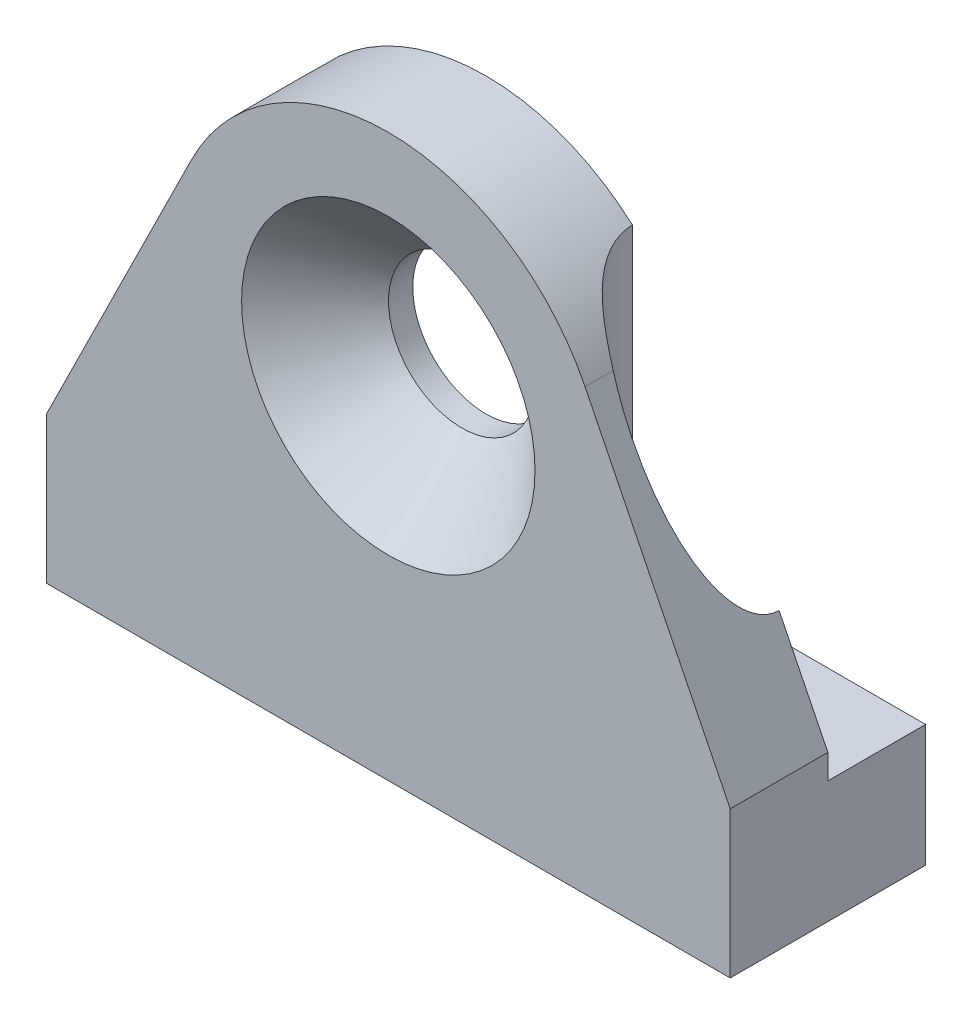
ISO-10303-21;
HEADER;
FILE_DESCRIPTION(('STEP AP214'),'2;1');
FILE_NAME('part.step','',(''),(''),'','','');
FILE_SCHEMA(('AUTOMOTIVE_DESIGN { 1 0 10303 214 1 1 1 1 }'));
ENDSEC;
DATA;
#1=APPLICATION_CONTEXT('core data for automotive mechanical design processes');
#2=APPLICATION_PROTOCOL_DEFINITION('international standard','automotive_design',2000,#1);
#3=PRODUCT_CONTEXT('',#1,'mechanical');
#4=PRODUCT('Part','Part','',(#3));
#5=PRODUCT_RELATED_PRODUCT_CATEGORY('part','',(#4));
#6=PRODUCT_DEFINITION_FORMATION('','',#4);
#7=PRODUCT_DEFINITION_CONTEXT('part definition',#1,'design');
#8=PRODUCT_DEFINITION('design','',#6,#7);
#9=PRODUCT_DEFINITION_SHAPE('','',#8);
#10=(LENGTH_UNIT() NAMED_UNIT(*) SI_UNIT(.MILLI.,.METRE.));
#11=(NAMED_UNIT(*) PLANE_ANGLE_UNIT() SI_UNIT($,.RADIAN.));
#12=(NAMED_UNIT(*) SI_UNIT($,.STERADIAN.) SOLID_ANGLE_UNIT());
#13=UNCERTAINTY_MEASURE_WITH_UNIT(LENGTH_MEASURE(1.E-05),#10,'distance_accuracy_value','');
#14=(GEOMETRIC_REPRESENTATION_CONTEXT(3) GLOBAL_UNCERTAINTY_ASSIGNED_CONTEXT((#13)) GLOBAL_UNIT_ASSIGNED_CONTEXT((#10,
#11,#12)) REPRESENTATION_CONTEXT('',''));
#15=CARTESIAN_POINT('',(0.,0.,0.));
#16=DIRECTION('',(0.,0.,1.));
#17=DIRECTION('',(1.,0.,0.));
#18=AXIS2_PLACEMENT_3D('',#15,#16,#17);
#19=CARTESIAN_POINT('',(0.,0.,6.35));
#20=DIRECTION('',(0.,0.,1.));
#21=DIRECTION('',(1.,0.,0.));
#22=AXIS2_PLACEMENT_3D('',#19,#20,#21);
#23=PLANE('',#22);
#24=CARTESIAN_POINT('',(0.,0.,6.35));
#25=DIRECTION('',(0.,0.,1.));
#26=DIRECTION('',(1.,0.,0.));
#27=AXIS2_PLACEMENT_3D('',#24,#25,#26);
#28=CIRCLE('',#27,9.5377);
#29=CARTESIAN_POINT('',(9.5377,0.,6.35));
#30=VERTEX_POINT('',#29);
#31=EDGE_CURVE('E11',#30,#30,#28,.F.);
#32=ORIENTED_EDGE('',*,*,#31,.T.);
#33=EDGE_LOOP('',(#32));
#34=FACE_BOUND('',#33,.T.);
#35=DIRECTION('',(0.,-1.,0.));
#36=VECTOR('',#35,1.);
#37=CARTESIAN_POINT('',(-22.225,-12.7,6.35));
#38=LINE('',#37,#36);
#39=CARTESIAN_POINT('',(-22.225,-12.7,6.35));
#40=VERTEX_POINT('',#39);
#41=CARTESIAN_POINT('',(-22.225,-22.225,6.35));
#42=VERTEX_POINT('',#41);
#43=EDGE_CURVE('E130',#40,#42,#38,.T.);
#44=ORIENTED_EDGE('',*,*,#43,.T.);
#45=DIRECTION('',(1.,0.,0.));
#46=VECTOR('',#45,1.);
#47=CARTESIAN_POINT('',(-22.225,-22.225,6.35));
#48=LINE('',#47,#46);
#49=CARTESIAN_POINT('',(22.225,-22.225,6.35));
#50=VERTEX_POINT('',#49);
#51=EDGE_CURVE('E81',#42,#50,#48,.T.);
#52=ORIENTED_EDGE('',*,*,#51,.T.);
#53=DIRECTION('',(0.,1.,0.));
#54=VECTOR('',#53,1.);
#55=CARTESIAN_POINT('',(22.225,-22.225,6.35));
#56=LINE('',#55,#54);
#57=CARTESIAN_POINT('',(22.225,-12.7,6.35));
#58=VERTEX_POINT('',#57);
#59=EDGE_CURVE('E96',#50,#58,#56,.T.);
#60=ORIENTED_EDGE('',*,*,#59,.T.);
#61=DIRECTION('',(-0.444025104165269,0.896014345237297,0.));
#62=VECTOR('',#61,1.);
#63=CARTESIAN_POINT('',(22.225,-12.7,6.35));
#64=LINE('',#63,#62);
#65=CARTESIAN_POINT('',(12.7904255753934,6.33836955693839,6.35));
#66=VERTEX_POINT('',#65);
#67=EDGE_CURVE('E90',#58,#66,#64,.T.);
#68=ORIENTED_EDGE('',*,*,#67,.T.);
#69=CARTESIAN_POINT('',(0.,0.,6.35));
#70=DIRECTION('',(0.,0.,1.));
#71=DIRECTION('',(1.,0.,0.));
#72=AXIS2_PLACEMENT_3D('',#69,#70,#71);
#73=CIRCLE('',#72,14.2748);
#74=CARTESIAN_POINT('',(-12.7904255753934,6.33836955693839,6.35));
#75=VERTEX_POINT('',#74);
#76=EDGE_CURVE('E93',#66,#75,#73,.T.);
#77=ORIENTED_EDGE('',*,*,#76,.T.);
#78=DIRECTION('',(-0.444025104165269,-0.896014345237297,0.));
#79=VECTOR('',#78,1.);
#80=CARTESIAN_POINT('',(-12.7904255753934,6.33836955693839,6.35));
#81=LINE('',#80,#79);
#82=EDGE_CURVE('E59',#75,#40,#81,.T.);
#83=ORIENTED_EDGE('',*,*,#82,.T.);
#84=EDGE_LOOP('',(#44,#52,#60,#68,#77,#83));
#85=FACE_BOUND('',#84,.T.);
#86=ADVANCED_FACE('F35',(#34,#85),#23,.T.);
#87=CARTESIAN_POINT('',(0.,0.,-6.35));
#88=DIRECTION('',(0.,0.,1.));
#89=DIRECTION('',(1.,0.,0.));
#90=AXIS2_PLACEMENT_3D('',#87,#88,#89);
#91=PLANE('',#90);
#92=DIRECTION('',(0.,-1.,0.));
#93=VECTOR('',#92,1.);
#94=CARTESIAN_POINT('',(-22.225,-12.7,-6.35));
#95=LINE('',#94,#93);
#96=CARTESIAN_POINT('',(-22.225,-14.3002,-6.35));
#97=VERTEX_POINT('',#96);
#98=CARTESIAN_POINT('',(-22.225,-22.225,-6.35));
#99=VERTEX_POINT('',#98);
#100=EDGE_CURVE('E123',#97,#99,#95,.T.);
#101=ORIENTED_EDGE('',*,*,#100,.F.);
#102=DIRECTION('',(1.,0.,0.));
#103=VECTOR('',#102,1.);
#104=CARTESIAN_POINT('',(0.,-14.3002,-6.35));
#105=LINE('',#104,#103);
#106=CARTESIAN_POINT('',(22.225,-14.3002,-6.35));
#107=VERTEX_POINT('',#106);
#108=EDGE_CURVE('E260',#97,#107,#105,.T.);
#109=ORIENTED_EDGE('',*,*,#108,.T.);
#110=DIRECTION('',(0.,1.,0.));
#111=VECTOR('',#110,1.);
#112=CARTESIAN_POINT('',(22.225,-22.225,-6.35));
#113=LINE('',#112,#111);
#114=CARTESIAN_POINT('',(22.225,-22.225,-6.35));
#115=VERTEX_POINT('',#114);
#116=EDGE_CURVE('E127',#115,#107,#113,.T.);
#117=ORIENTED_EDGE('',*,*,#116,.F.);
#118=DIRECTION('',(1.,0.,0.));
#119=VECTOR('',#118,1.);
#120=CARTESIAN_POINT('',(-22.225,-22.225,-6.35));
#121=LINE('',#120,#119);
#122=EDGE_CURVE('E75',#99,#115,#121,.T.);
#123=ORIENTED_EDGE('',*,*,#122,.F.);
#124=EDGE_LOOP('',(#101,#109,#117,#123));
#125=FACE_BOUND('',#124,.T.);
#126=ADVANCED_FACE('F259',(#125),#91,.F.);
#127=CARTESIAN_POINT('',(-22.225,-12.7,6.35));
#128=DIRECTION('',(1.,0.,0.));
#129=DIRECTION('',(0.,1.,0.));
#130=AXIS2_PLACEMENT_3D('',#127,#128,#129);
#131=PLANE('',#130);
#132=DIRECTION('',(0.,-1.,0.));
#133=VECTOR('',#132,1.);
#134=CARTESIAN_POINT('',(-22.225,-12.7,0.));
#135=LINE('',#134,#133);
#136=CARTESIAN_POINT('',(-22.225,-12.7,0.));
#137=VERTEX_POINT('',#136);
#138=CARTESIAN_POINT('',(-22.225,-14.3002,0.));
#139=VERTEX_POINT('',#138);
#140=EDGE_CURVE('E443',#137,#139,#135,.T.);
#141=ORIENTED_EDGE('',*,*,#140,.T.);
#142=DIRECTION('',(0.,0.,1.));
#143=VECTOR('',#142,1.);
#144=CARTESIAN_POINT('',(-22.225,-14.3002,-25.4));
#145=LINE('',#144,#143);
#146=EDGE_CURVE('E256',#97,#139,#145,.T.);
#147=ORIENTED_EDGE('',*,*,#146,.F.);
#148=ORIENTED_EDGE('',*,*,#100,.T.);
#149=DIRECTION('',(0.,0.,-1.));
#150=VECTOR('',#149,1.);
#151=CARTESIAN_POINT('',(-22.225,-22.225,6.35));
#152=LINE('',#151,#150);
#153=EDGE_CURVE('E137',#42,#99,#152,.T.);
#154=ORIENTED_EDGE('',*,*,#153,.F.);
#155=ORIENTED_EDGE('',*,*,#43,.F.);
#156=DIRECTION('',(0.,0.,-1.));
#157=VECTOR('',#156,1.);
#158=CARTESIAN_POINT('',(-22.225,-12.7,6.35));
#159=LINE('',#158,#157);
#160=EDGE_CURVE('E119',#40,#137,#159,.T.);
#161=ORIENTED_EDGE('',*,*,#160,.T.);
#162=EDGE_LOOP('',(#141,#147,#148,#154,#155,#161));
#163=FACE_BOUND('',#162,.T.);
#164=ADVANCED_FACE('F252',(#163),#131,.F.);
#165=CARTESIAN_POINT('',(-22.225,-22.225,6.35));
#166=DIRECTION('',(0.,1.,0.));
#167=DIRECTION('',(-1.,0.,0.));
#168=AXIS2_PLACEMENT_3D('',#165,#166,#167);
#169=PLANE('',#168);
#170=CARTESIAN_POINT('',(14.2875,-22.225,0.));
#171=DIRECTION('',(0.,-1.,0.));
#172=DIRECTION('',(1.,0.,0.));
#173=AXIS2_PLACEMENT_3D('',#170,#171,#172);
#174=CIRCLE('',#173,3.175);
#175=CARTESIAN_POINT('',(17.4625,-22.225,0.));
#176=VERTEX_POINT('',#175);
#177=EDGE_CURVE('E186',#176,#176,#174,.T.);
#178=ORIENTED_EDGE('',*,*,#177,.F.);
#179=EDGE_LOOP('',(#178));
#180=FACE_BOUND('',#179,.T.);
#181=CARTESIAN_POINT('',(-14.2875,-22.225,0.));
#182=DIRECTION('',(0.,-1.,0.));
#183=DIRECTION('',(1.,0.,0.));
#184=AXIS2_PLACEMENT_3D('',#181,#182,#183);
#185=CIRCLE('',#184,3.175);
#186=CARTESIAN_POINT('',(-11.1125,-22.225,0.));
#187=VERTEX_POINT('',#186);
#188=EDGE_CURVE('E125',#187,#187,#185,.T.);
#189=ORIENTED_EDGE('',*,*,#188,.F.);
#190=EDGE_LOOP('',(#189));
#191=FACE_BOUND('',#190,.T.);
#192=ORIENTED_EDGE('',*,*,#122,.T.);
#193=DIRECTION('',(0.,0.,-1.));
#194=VECTOR('',#193,1.);
#195=CARTESIAN_POINT('',(22.225,-22.225,6.35));
#196=LINE('',#195,#194);
#197=EDGE_CURVE('E135',#50,#115,#196,.T.);
#198=ORIENTED_EDGE('',*,*,#197,.F.);
#199=ORIENTED_EDGE('',*,*,#51,.F.);
#200=ORIENTED_EDGE('',*,*,#153,.T.);
#201=EDGE_LOOP('',(#192,#198,#199,#200));
#202=FACE_BOUND('',#201,.T.);
#203=ADVANCED_FACE('F195',(#180,#191,#202),#169,.F.);
#204=CARTESIAN_POINT('',(22.225,-22.225,6.35));
#205=DIRECTION('',(-1.,0.,0.));
#206=DIRECTION('',(0.,-1.,0.));
#207=AXIS2_PLACEMENT_3D('',#204,#205,#206);
#208=PLANE('',#207);
#209=ORIENTED_EDGE('',*,*,#116,.T.);
#210=DIRECTION('',(0.,0.,1.));
#211=VECTOR('',#210,1.);
#212=CARTESIAN_POINT('',(22.225,-14.3002,-25.4));
#213=LINE('',#212,#211);
#214=CARTESIAN_POINT('',(22.225,-14.3002,0.));
#215=VERTEX_POINT('',#214);
#216=EDGE_CURVE('E261',#107,#215,#213,.T.);
#217=ORIENTED_EDGE('',*,*,#216,.T.);
#218=DIRECTION('',(0.,1.,0.));
#219=VECTOR('',#218,1.);
#220=CARTESIAN_POINT('',(22.225,-14.3002,0.));
#221=LINE('',#220,#219);
#222=CARTESIAN_POINT('',(22.225,-12.7,0.));
#223=VERTEX_POINT('',#222);
#224=EDGE_CURVE('E202',#215,#223,#221,.T.);
#225=ORIENTED_EDGE('',*,*,#224,.T.);
#226=DIRECTION('',(0.,0.,-1.));
#227=VECTOR('',#226,1.);
#228=CARTESIAN_POINT('',(22.225,-12.7,6.35));
#229=LINE('',#228,#227);
#230=EDGE_CURVE('E112',#58,#223,#229,.T.);
#231=ORIENTED_EDGE('',*,*,#230,.F.);
#232=ORIENTED_EDGE('',*,*,#59,.F.);
#233=ORIENTED_EDGE('',*,*,#197,.T.);
#234=EDGE_LOOP('',(#209,#217,#225,#231,#232,#233));
#235=FACE_BOUND('',#234,.T.);
#236=ADVANCED_FACE('F198',(#235),#208,.F.);
#237=CARTESIAN_POINT('',(22.225,-12.7,6.35));
#238=DIRECTION('',(-0.896014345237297,-0.444025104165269,0.));
#239=DIRECTION('',(0.44402510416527,-0.896014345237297,0.));
#240=AXIS2_PLACEMENT_3D('',#237,#238,#239);
#241=PLANE('',#240);
#242=ORIENTED_EDGE('',*,*,#230,.T.);
#243=DIRECTION('',(-0.444025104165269,0.896014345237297,0.));
#244=VECTOR('',#243,1.);
#245=CARTESIAN_POINT('',(22.225,-12.7,0.));
#246=LINE('',#245,#244);
#247=CARTESIAN_POINT('',(19.05,-6.29305246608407,0.));
#248=VERTEX_POINT('',#247);
#249=EDGE_CURVE('E205',#223,#248,#246,.T.);
#250=ORIENTED_EDGE('',*,*,#249,.T.);
#251=CARTESIAN_POINT('',(14.2875,3.31736883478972,0.));
#252=DIRECTION('',(-0.896014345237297,-0.444025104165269,0.));
#253=DIRECTION('',(0.44402510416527,-0.896014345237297,0.));
#254=AXIS2_PLACEMENT_3D('',#251,#252,#253);
#255=ELLIPSE('',#254,10.7257449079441,4.7625);
#256=CARTESIAN_POINT('',(12.7904255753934,6.33836955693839,4.52108111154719));
#257=VERTEX_POINT('',#256);
#258=EDGE_CURVE('E108',#248,#257,#255,.T.);
#259=ORIENTED_EDGE('',*,*,#258,.T.);
#260=DIRECTION('',(0.,0.,-1.));
#261=VECTOR('',#260,1.);
#262=CARTESIAN_POINT('',(12.7904255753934,6.33836955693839,6.35));
#263=LINE('',#262,#261);
#264=EDGE_CURVE('E103',#66,#257,#263,.T.);
#265=ORIENTED_EDGE('',*,*,#264,.F.);
#266=ORIENTED_EDGE('',*,*,#67,.F.);
#267=EDGE_LOOP('',(#242,#250,#259,#265,#266));
#268=FACE_BOUND('',#267,.T.);
#269=ADVANCED_FACE('F104',(#268),#241,.F.);
#270=CARTESIAN_POINT('',(0.,0.,6.35));
#271=DIRECTION('',(0.,0.,-1.));
#272=DIRECTION('',(-1.,0.,0.));
#273=AXIS2_PLACEMENT_3D('',#270,#271,#272);
#274=CYLINDRICAL_SURFACE('',#273,14.2748);
#275=CARTESIAN_POINT('',(14.2748,0.,4.76248306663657));
#276=CARTESIAN_POINT('',(14.274800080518,0.200291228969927,4.76248274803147));
#277=CARTESIAN_POINT('',(14.2705839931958,0.400580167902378,4.76247733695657));
#278=CARTESIAN_POINT('',(14.2537265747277,0.800821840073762,4.76238778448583));
#279=CARTESIAN_POINT('',(14.2410845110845,1.00077454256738,4.76230363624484));
#280=CARTESIAN_POINT('',(14.20739063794,1.40004237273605,4.76185598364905));
#281=CARTESIAN_POINT('',(14.1863357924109,1.59935724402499,4.76149237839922));
#282=CARTESIAN_POINT('',(14.1358509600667,1.99694609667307,4.7601519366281));
#283=CARTESIAN_POINT('',(14.1064199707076,2.19521995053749,4.75917502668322));
#284=CARTESIAN_POINT('',(14.0391979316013,2.5905770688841,4.75614188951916));
#285=CARTESIAN_POINT('',(14.0013971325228,2.78765866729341,4.75408439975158));
#286=CARTESIAN_POINT('',(13.9175325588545,3.18000629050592,4.74829407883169));
#287=CARTESIAN_POINT('',(13.8714698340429,3.37527254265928,4.74456146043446));
#288=CARTESIAN_POINT('',(13.7711901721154,3.76356545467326,4.73469838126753));
#289=CARTESIAN_POINT('',(13.7169762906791,3.9565929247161,4.72856881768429));
#290=CARTESIAN_POINT('',(13.6005143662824,4.34005485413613,4.71305685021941));
#291=CARTESIAN_POINT('',(13.5382671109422,4.53048956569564,4.70367476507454));
#292=CARTESIAN_POINT('',(13.3869054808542,4.96256200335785,4.67737386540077));
#293=CARTESIAN_POINT('',(13.295205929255,5.20321929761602,4.659065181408));
#294=CARTESIAN_POINT('',(13.0992943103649,5.6784174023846,4.61299207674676));
#295=CARTESIAN_POINT('',(12.9950853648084,5.91295972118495,4.58523001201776));
#296=CARTESIAN_POINT('',(12.7751490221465,6.37421571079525,4.51745722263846));
#297=CARTESIAN_POINT('',(12.6594452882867,6.60094422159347,4.47747132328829));
#298=CARTESIAN_POINT('',(12.41758719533,7.04537770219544,4.38197833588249));
#299=CARTESIAN_POINT('',(12.291437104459,7.263086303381,4.32647756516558));
#300=CARTESIAN_POINT('',(12.0730752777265,7.61833549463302,4.21750793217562));
#301=CARTESIAN_POINT('',(11.983179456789,7.75890804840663,4.16925603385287));
#302=CARTESIAN_POINT('',(11.800371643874,8.0342030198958,4.06285441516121));
#303=CARTESIAN_POINT('',(11.7074605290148,8.16892711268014,4.00470755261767));
#304=CARTESIAN_POINT('',(11.519758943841,8.43155287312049,3.87735235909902));
#305=CARTESIAN_POINT('',(11.4249699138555,8.5594595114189,3.80815223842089));
#306=CARTESIAN_POINT('',(11.2349137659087,8.80744383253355,3.65757102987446));
#307=CARTESIAN_POINT('',(11.1396467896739,8.92752370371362,3.57619336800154));
#308=CARTESIAN_POINT('',(10.9006663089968,9.21938305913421,3.35403458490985));
#309=CARTESIAN_POINT('',(10.7577160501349,9.3852947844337,3.20446597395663));
#310=CARTESIAN_POINT('',(10.4827801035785,9.69141832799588,2.87259570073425));
#311=CARTESIAN_POINT('',(10.3507812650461,9.83166122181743,2.69033415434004));
#312=CARTESIAN_POINT('',(10.1269441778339,10.0616333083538,2.32576138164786));
#313=CARTESIAN_POINT('',(10.0320626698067,10.1558622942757,2.14820836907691));
#314=CARTESIAN_POINT('',(9.90508167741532,10.2792396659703,1.8672017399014));
#315=CARTESIAN_POINT('',(9.86529739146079,10.3173839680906,1.77104099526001));
#316=CARTESIAN_POINT('',(9.791517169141,10.3874295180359,1.57434291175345));
#317=CARTESIAN_POINT('',(9.75751885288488,10.4193333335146,1.47380739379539));
#318=CARTESIAN_POINT('',(9.69577097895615,10.4768188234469,1.26845972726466));
#319=CARTESIAN_POINT('',(9.66805498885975,10.5023666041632,1.1636279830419));
#320=CARTESIAN_POINT('',(9.61964416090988,10.5467265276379,0.951003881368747));
#321=CARTESIAN_POINT('',(9.59894625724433,10.5655416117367,0.843212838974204));
#322=CARTESIAN_POINT('',(9.56496897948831,10.5963111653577,0.625496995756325));
#323=CARTESIAN_POINT('',(9.55168981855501,10.6082654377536,0.515572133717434));
#324=CARTESIAN_POINT('',(9.53282281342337,10.625223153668,0.294535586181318));
#325=CARTESIAN_POINT('',(9.52723437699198,10.630227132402,0.183423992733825));
#326=CARTESIAN_POINT('',(9.52400569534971,10.6331195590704,-0.0294348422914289));
#327=CARTESIAN_POINT('',(9.52572313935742,10.6315830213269,-0.131165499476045));
#328=CARTESIAN_POINT('',(9.53564645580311,10.6226835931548,-0.334088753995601));
#329=CARTESIAN_POINT('',(9.54385443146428,10.6153188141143,-0.435281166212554));
#330=CARTESIAN_POINT('',(9.56661438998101,10.594811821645,-0.636294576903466));
#331=CARTESIAN_POINT('',(9.5811626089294,10.5816730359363,-0.736116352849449));
#332=CARTESIAN_POINT('',(9.61636164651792,10.5496951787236,-0.933785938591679));
#333=CARTESIAN_POINT('',(9.63701474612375,10.5308539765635,-1.0316329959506));
#334=CARTESIAN_POINT('',(9.68382635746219,10.4878224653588,-1.22362073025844));
#335=CARTESIAN_POINT('',(9.70992256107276,10.4636925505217,-1.31779014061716));
#336=CARTESIAN_POINT('',(9.7673384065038,10.4101179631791,-1.50298448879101));
#337=CARTESIAN_POINT('',(9.79865989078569,10.3806714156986,-1.59400830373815));
#338=CARTESIAN_POINT('',(9.89975496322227,10.2846201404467,-1.86154418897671));
#339=CARTESIAN_POINT('',(9.97669905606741,10.2102679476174,-2.03267999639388));
#340=CARTESIAN_POINT('',(10.1515120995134,10.0365798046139,-2.36931679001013));
#341=CARTESIAN_POINT('',(10.250503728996,9.93580867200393,-2.53347790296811));
#342=CARTESIAN_POINT('',(10.4599931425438,9.71501775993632,-2.84008847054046));
#343=CARTESIAN_POINT('',(10.5704970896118,9.59498765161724,-2.98252619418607));
#344=CARTESIAN_POINT('',(10.7687125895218,9.37128952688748,-3.2119002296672));
#345=CARTESIAN_POINT('',(10.8550246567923,9.27128889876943,-3.30371404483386));
#346=CARTESIAN_POINT('',(11.0294047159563,9.06314349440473,-3.47580582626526));
#347=CARTESIAN_POINT('',(11.1174733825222,8.95499554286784,-3.5560792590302));
#348=CARTESIAN_POINT('',(11.2939171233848,8.73141833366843,-3.70584493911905));
#349=CARTESIAN_POINT('',(11.3822924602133,8.61597820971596,-3.7753205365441));
#350=CARTESIAN_POINT('',(11.5579820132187,8.37882885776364,-3.90422979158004));
#351=CARTESIAN_POINT('',(11.6452958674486,8.25711756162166,-3.96366010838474));
#352=CARTESIAN_POINT('',(11.8605984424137,7.94652914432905,-4.10060529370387));
#353=CARTESIAN_POINT('',(11.9872975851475,7.75426170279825,-4.17248378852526));
#354=CARTESIAN_POINT('',(12.2335051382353,7.35971777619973,-4.29903266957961));
#355=CARTESIAN_POINT('',(12.3530098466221,7.15743623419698,-4.35369425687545));
#356=CARTESIAN_POINT('',(12.5833249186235,6.7443215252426,-4.44890424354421));
#357=CARTESIAN_POINT('',(12.6941193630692,6.53347372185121,-4.48942724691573));
#358=CARTESIAN_POINT('',(12.9056851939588,6.10494654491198,-4.55898902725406));
#359=CARTESIAN_POINT('',(13.0064534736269,5.88726508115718,-4.58802425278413));
#360=CARTESIAN_POINT('',(13.2476950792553,5.32948291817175,-4.65005196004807));
#361=CARTESIAN_POINT('',(13.3809535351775,4.98557048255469,-4.67700468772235));
#362=CARTESIAN_POINT('',(13.6206446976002,4.28768963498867,-4.71714412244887));
#363=CARTESIAN_POINT('',(13.7270641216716,3.93371634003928,-4.73032402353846));
#364=CARTESIAN_POINT('',(13.9121922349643,3.21828815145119,-4.74860043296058));
#365=CARTESIAN_POINT('',(13.9908918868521,2.8568308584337,-4.75369430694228));
#366=CARTESIAN_POINT('',(14.1199906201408,2.12894338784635,-4.75999162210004));
#367=CARTESIAN_POINT('',(14.1703943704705,1.76251404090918,-4.76119570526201));
#368=CARTESIAN_POINT('',(14.2435891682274,1.01692804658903,-4.76244332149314));
#369=CARTESIAN_POINT('',(14.2655995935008,0.637694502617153,-4.76245470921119));
#370=CARTESIAN_POINT('',(14.279330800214,-0.121352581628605,-4.76249782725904));
#371=CARTESIAN_POINT('',(14.2710488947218,-0.501166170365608,-4.76252955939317));
#372=CARTESIAN_POINT('',(14.2242352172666,-1.25907346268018,-4.76213685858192));
#373=CARTESIAN_POINT('',(14.1856913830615,-1.63716641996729,-4.76171224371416));
#374=CARTESIAN_POINT('',(14.0785864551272,-2.38903010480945,-4.75821825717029));
#375=CARTESIAN_POINT('',(14.0100297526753,-2.76280145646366,-4.75514927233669));
#376=CARTESIAN_POINT('',(13.8553602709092,-3.45030318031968,-4.74338934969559));
#377=CARTESIAN_POINT('',(13.7731888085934,-3.76493957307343,-4.73557015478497));
#378=CARTESIAN_POINT('',(13.5876341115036,-4.38766916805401,-4.71172570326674));
#379=CARTESIAN_POINT('',(13.4842481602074,-4.69576152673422,-4.69569939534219));
#380=CARTESIAN_POINT('',(13.2572653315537,-5.30279420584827,-4.65116918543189));
#381=CARTESIAN_POINT('',(13.1337107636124,-5.60175216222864,-4.62269119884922));
#382=CARTESIAN_POINT('',(12.8675284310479,-6.18871944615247,-4.54798927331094));
#383=CARTESIAN_POINT('',(12.7249128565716,-6.47673562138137,-4.5017766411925));
#384=CARTESIAN_POINT('',(12.4866906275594,-6.92000778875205,-4.40989675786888));
#385=CARTESIAN_POINT('',(12.3966704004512,-7.07995743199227,-4.37224304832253));
#386=CARTESIAN_POINT('',(12.2117088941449,-7.39441055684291,-4.28752283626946));
#387=CARTESIAN_POINT('',(12.1167689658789,-7.54891551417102,-4.24045890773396));
#388=CARTESIAN_POINT('',(11.9229291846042,-7.85149269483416,-4.13549847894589));
#389=CARTESIAN_POINT('',(11.8240322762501,-7.99956953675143,-4.07760992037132));
#390=CARTESIAN_POINT('',(11.6234478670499,-8.2883196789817,-3.94947953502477));
#391=CARTESIAN_POINT('',(11.5217610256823,-8.4289947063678,-3.87924060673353));
#392=CARTESIAN_POINT('',(11.3396295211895,-8.67181992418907,-3.74185388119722));
#393=CARTESIAN_POINT('',(11.259408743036,-8.77566120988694,-3.67739657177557));
#394=CARTESIAN_POINT('',(11.0992486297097,-8.97736953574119,-3.53943856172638));
#395=CARTESIAN_POINT('',(11.0193092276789,-9.07523810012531,-3.46594018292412));
#396=CARTESIAN_POINT('',(10.8609337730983,-9.26419009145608,-3.30944569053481));
#397=CARTESIAN_POINT('',(10.7824963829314,-9.35527978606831,-3.22645853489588));
#398=CARTESIAN_POINT('',(10.6284094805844,-9.52997293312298,-3.05059333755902));
#399=CARTESIAN_POINT('',(10.5527593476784,-9.61357805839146,-2.95771751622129));
#400=CARTESIAN_POINT('',(10.4206700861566,-9.75638303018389,-2.7818263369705));
#401=CARTESIAN_POINT('',(10.3634443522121,-9.81709537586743,-2.70062635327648));
#402=CARTESIAN_POINT('',(10.2525699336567,-9.93283158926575,-2.5319802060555));
#403=CARTESIAN_POINT('',(10.1989204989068,-9.98785665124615,-2.44453536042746));
#404=CARTESIAN_POINT('',(10.0960402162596,-10.0918403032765,-2.26360381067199));
#405=CARTESIAN_POINT('',(10.0468102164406,-10.1407977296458,-2.17011595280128));
#406=CARTESIAN_POINT('',(9.9536643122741,-10.232240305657,-1.97755061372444));
#407=CARTESIAN_POINT('',(9.90974582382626,-10.2747286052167,-1.87847588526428));
#408=CARTESIAN_POINT('',(9.82773457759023,-10.3532021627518,-1.67453310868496));
#409=CARTESIAN_POINT('',(9.7896849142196,-10.3891396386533,-1.56962925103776));
#410=CARTESIAN_POINT('',(9.72057248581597,-10.4538331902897,-1.35544623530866));
#411=CARTESIAN_POINT('',(9.68950651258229,-10.4825925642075,-1.24616911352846));
#412=CARTESIAN_POINT('',(9.6350011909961,-10.5327128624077,-1.02407696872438));
#413=CARTESIAN_POINT('',(9.61156120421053,-10.5540744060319,-0.911262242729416));
#414=CARTESIAN_POINT('',(9.57282245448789,-10.5892243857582,-0.683087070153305));
#415=CARTESIAN_POINT('',(9.5575227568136,-10.6030136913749,-0.567726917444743));
#416=CARTESIAN_POINT('',(9.53663602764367,-10.6218011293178,-0.3484838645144));
#417=CARTESIAN_POINT('',(9.53015707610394,-10.6276072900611,-0.244753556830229));
#418=CARTESIAN_POINT('',(9.52400783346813,-10.63311846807,-0.0368919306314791));
#419=CARTESIAN_POINT('',(9.52433973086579,-10.6328215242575,0.0672395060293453));
#420=CARTESIAN_POINT('',(9.53181025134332,-10.6261250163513,0.274987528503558));
#421=CARTESIAN_POINT('',(9.53894419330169,-10.6197296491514,0.378604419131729));
#422=CARTESIAN_POINT('',(9.559886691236,-10.6008810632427,0.584642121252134));
#423=CARTESIAN_POINT('',(9.57369771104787,-10.588425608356,0.687062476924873));
#424=CARTESIAN_POINT('',(9.60709486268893,-10.5581310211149,0.885994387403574));
#425=CARTESIAN_POINT('',(9.62643741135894,-10.5405183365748,0.982581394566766));
#426=CARTESIAN_POINT('',(9.67075136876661,-10.4998753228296,1.17330449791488));
#427=CARTESIAN_POINT('',(9.69572473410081,-10.476843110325,1.2674397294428));
#428=CARTESIAN_POINT('',(9.77851621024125,-10.3998197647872,1.54521373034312));
#429=CARTESIAN_POINT('',(9.84423888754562,-10.3378726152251,1.72441265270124));
#430=CARTESIAN_POINT('',(9.99647681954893,-10.1907824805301,2.07532355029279));
#431=CARTESIAN_POINT('',(10.0838543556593,-10.1046501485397,2.24623623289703));
#432=CARTESIAN_POINT('',(10.2725077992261,-9.91279674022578,2.5682852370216));
#433=CARTESIAN_POINT('',(10.3737907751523,-9.80706569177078,2.71941142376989));
#434=CARTESIAN_POINT('',(10.5542517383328,-9.61196439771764,2.95969770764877));
#435=CARTESIAN_POINT('',(10.6312365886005,-9.52684655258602,3.05405775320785));
#436=CARTESIAN_POINT('',(10.7880883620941,-9.34885684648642,3.23258996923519));
#437=CARTESIAN_POINT('',(10.8679562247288,-9.25598244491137,3.31675877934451));
#438=CARTESIAN_POINT('',(11.0292181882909,-9.0632264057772,3.47531531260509));
#439=CARTESIAN_POINT('',(11.1106140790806,-8.96333611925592,3.54969062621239));
#440=CARTESIAN_POINT('',(11.2736423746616,-8.75740661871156,3.68911586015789));
#441=CARTESIAN_POINT('',(11.3552748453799,-8.65136549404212,3.75416286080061));
#442=CARTESIAN_POINT('',(11.5539979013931,-8.38531576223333,3.90267821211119));
#443=CARTESIAN_POINT('',(11.6706590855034,-8.22233714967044,3.98141753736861));
#444=CARTESIAN_POINT('',(11.8999227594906,-7.88689410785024,4.12299014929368));
#445=CARTESIAN_POINT('',(12.0125233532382,-7.7144253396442,4.18581608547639));
#446=CARTESIAN_POINT('',(12.2321288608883,-7.36126699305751,4.2979161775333));
#447=CARTESIAN_POINT('',(12.3391229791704,-7.18056272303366,4.34716491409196));
#448=CARTESIAN_POINT('',(12.5461065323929,-6.81247169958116,4.43413446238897));
#449=CARTESIAN_POINT('',(12.6460936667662,-6.6250827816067,4.47185150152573));
#450=CARTESIAN_POINT('',(12.893404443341,-6.13534805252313,4.556704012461));
#451=CARTESIAN_POINT('',(13.0349098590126,-5.82882549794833,4.59679569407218));
#452=CARTESIAN_POINT('',(13.2963449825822,-5.20497162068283,4.6601602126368));
#453=CARTESIAN_POINT('',(13.4162613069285,-4.88763373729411,4.68342264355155));
#454=CARTESIAN_POINT('',(13.6333159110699,-4.24472808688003,4.71863619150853));
#455=CARTESIAN_POINT('',(13.73045631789,-3.91916109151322,4.73058836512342));
#456=CARTESIAN_POINT('',(13.9012696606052,-3.26188198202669,4.74758968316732));
#457=CARTESIAN_POINT('',(13.9749510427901,-2.93017212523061,4.75264131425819));
#458=CARTESIAN_POINT('',(14.0762855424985,-2.38232530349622,4.75797538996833));
#459=CARTESIAN_POINT('',(14.110965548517,-2.16746886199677,4.75931910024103));
#460=CARTESIAN_POINT('',(14.1704717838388,-1.73637060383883,4.76115599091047));
#461=CARTESIAN_POINT('',(14.1952974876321,-1.52012871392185,4.76164912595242));
#462=CARTESIAN_POINT('',(14.2350313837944,-1.08679675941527,4.76225213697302));
#463=CARTESIAN_POINT('',(14.2499422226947,-0.86970693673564,4.76236211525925));
#464=CARTESIAN_POINT('',(14.2698263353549,-0.435077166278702,4.76247775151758));
#465=CARTESIAN_POINT('',(14.2747999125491,-0.21753723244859,4.76248341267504));
#466=CARTESIAN_POINT('',(14.2748,0.,4.76248306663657));
#467=B_SPLINE_CURVE_WITH_KNOTS('',3,(#275,#276,#277,#278,#279,#280,#281,#282,#283,#284,#285,
#286,#287,#288,#289,#290,#291,#292,#293,#294,#295,#296,#297,#298,#299,#300,#301,#302,#303,#304,
#305,#306,#307,#308,#309,#310,#311,#312,#313,#314,#315,#316,#317,#318,#319,#320,#321,#322,#323,
#324,#325,#326,#327,#328,#329,#330,#331,#332,#333,#334,#335,#336,#337,#338,#339,#340,#341,#342,
#343,#344,#345,#346,#347,#348,#349,#350,#351,#352,#353,#354,#355,#356,#357,#358,#359,#360,#361,
#362,#363,#364,#365,#366,#367,#368,#369,#370,#371,#372,#373,#374,#375,#376,#377,#378,#379,#380,
#381,#382,#383,#384,#385,#386,#387,#388,#389,#390,#391,#392,#393,#394,#395,#396,#397,#398,#399,
#400,#401,#402,#403,#404,#405,#406,#407,#408,#409,#410,#411,#412,#413,#414,#415,#416,#417,#418,
#419,#420,#421,#422,#423,#424,#425,#426,#427,#428,#429,#430,#431,#432,#433,#434,#435,#436,#437,
#438,#439,#440,#441,#442,#443,#444,#445,#446,#447,#448,#449,#450,#451,#452,#453,#454,#455,#456,
#457,#458,#459,#460,#461,#462,#463,#464,#465,#466),.UNSPECIFIED.,.T.,.F.,(4,2,2,2,2,2,2,2,2,2,2,
2,2,2,2,2,2,2,2,2,2,2,2,2,2,2,2,2,2,2,2,2,2,2,2,2,2,2,2,2,2,2,2,2,2,2,2,2,2,2,2,2,2,2,2,2,2,2,2,
2,2,2,2,2,2,2,2,2,2,2,2,2,2,2,2,2,2,2,2,2,2,2,2,2,2,2,2,2,2,2,2,2,2,2,2,4),(0.,
0.600825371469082,1.20170298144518,1.80279763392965,2.40396426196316,3.00583486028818,
3.60762903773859,4.20919817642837,4.81070837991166,5.58474615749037,6.35859117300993,
7.13087491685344,7.90284465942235,8.4235828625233,8.94417092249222,9.4643740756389,
9.98443115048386,10.7769090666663,11.5684211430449,12.2321524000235,12.5643113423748,
12.8963333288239,13.2300896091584,13.5636999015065,13.8973197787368,14.2309139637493,
14.5358143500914,14.840813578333,15.1456319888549,15.450564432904,15.7521810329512,
16.0539042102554,16.6568520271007,17.3041399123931,17.9517761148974,18.4337641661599,
18.9159410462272,19.3988542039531,19.8819276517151,20.6044340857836,21.3273091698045,
22.051476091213,22.7758667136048,23.8836736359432,24.9920277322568,26.1007428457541,
27.2092749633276,28.3476765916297,29.486179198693,30.6251358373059,31.7639258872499,
32.7389851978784,33.7141694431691,34.6873336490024,35.6598784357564,36.2216563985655,
36.7832809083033,37.3444949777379,37.9055775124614,38.3438090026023,38.7819281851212,
39.2196371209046,39.657247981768,40.0061854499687,40.3550494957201,40.7039803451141,
41.0527407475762,41.4039512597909,41.7550001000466,42.1060195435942,42.4569986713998,
42.7688899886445,43.0808815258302,43.3926585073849,43.7045506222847,44.0043997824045,
44.3043532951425,44.9036766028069,45.5324187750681,46.1614817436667,46.6066546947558,
47.0519740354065,47.4978523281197,47.9438698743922,48.5888794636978,49.2341864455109,
49.8806934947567,50.5274118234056,51.5457872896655,52.5647919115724,53.5837013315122,
54.6022434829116,55.2549621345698,55.9077155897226,56.560294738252,57.2128539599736),.UNSPECIFIED.);
#468=CARTESIAN_POINT('',(9.52499999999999,10.6322288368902,0.));
#469=VERTEX_POINT('',#468);
#470=EDGE_CURVE('E147',#257,#469,#467,.T.);
#471=ORIENTED_EDGE('',*,*,#470,.T.);
#472=CARTESIAN_POINT('',(0.,0.,0.));
#473=DIRECTION('',(0.,0.,1.));
#474=DIRECTION('',(1.,0.,0.));
#475=AXIS2_PLACEMENT_3D('',#472,#473,#474);
#476=CIRCLE('',#475,14.2748);
#477=CARTESIAN_POINT('',(-9.525,10.6322288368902,0.));
#478=VERTEX_POINT('',#477);
#479=EDGE_CURVE('E239',#469,#478,#476,.T.);
#480=ORIENTED_EDGE('',*,*,#479,.T.);
#481=CARTESIAN_POINT('',(-14.2748,0.,4.76248306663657));
#482=CARTESIAN_POINT('',(-14.274800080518,-0.200291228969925,4.76248274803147));
#483=CARTESIAN_POINT('',(-14.2705839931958,-0.400580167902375,4.76247733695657));
#484=CARTESIAN_POINT('',(-14.2537265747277,-0.800821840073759,4.76238778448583));
#485=CARTESIAN_POINT('',(-14.2410845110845,-1.00077454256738,4.76230363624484));
#486=CARTESIAN_POINT('',(-14.20739063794,-1.40004237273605,4.76185598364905));
#487=CARTESIAN_POINT('',(-14.1863357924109,-1.59935724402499,4.76149237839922));
#488=CARTESIAN_POINT('',(-14.1358509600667,-1.99694609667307,4.7601519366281));
#489=CARTESIAN_POINT('',(-14.1064199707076,-2.19521995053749,4.75917502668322));
#490=CARTESIAN_POINT('',(-14.0391979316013,-2.5905770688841,4.75614188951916));
#491=CARTESIAN_POINT('',(-14.0013971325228,-2.78765866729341,4.75408439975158));
#492=CARTESIAN_POINT('',(-13.9175325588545,-3.18000629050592,4.74829407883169));
#493=CARTESIAN_POINT('',(-13.8714698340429,-3.37527254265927,4.74456146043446));
#494=CARTESIAN_POINT('',(-13.7711901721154,-3.76356545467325,4.73469838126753));
#495=CARTESIAN_POINT('',(-13.7169762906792,-3.9565929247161,4.72856881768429));
#496=CARTESIAN_POINT('',(-13.6005143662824,-4.34005485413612,4.71305685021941));
#497=CARTESIAN_POINT('',(-13.5382671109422,-4.53048956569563,4.70367476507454));
#498=CARTESIAN_POINT('',(-13.3869054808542,-4.96256200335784,4.67737386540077));
#499=CARTESIAN_POINT('',(-13.295205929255,-5.20321929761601,4.659065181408));
#500=CARTESIAN_POINT('',(-13.0992943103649,-5.67841740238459,4.61299207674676));
#501=CARTESIAN_POINT('',(-12.9950853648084,-5.91295972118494,4.58523001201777));
#502=CARTESIAN_POINT('',(-12.7751490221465,-6.37421571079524,4.51745722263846));
#503=CARTESIAN_POINT('',(-12.6594452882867,-6.60094422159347,4.4774713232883));
#504=CARTESIAN_POINT('',(-12.41758719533,-7.04537770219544,4.38197833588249));
#505=CARTESIAN_POINT('',(-12.291437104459,-7.263086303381,4.32647756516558));
#506=CARTESIAN_POINT('',(-12.0730752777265,-7.61833549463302,4.21750793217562));
#507=CARTESIAN_POINT('',(-11.983179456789,-7.75890804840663,4.16925603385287));
#508=CARTESIAN_POINT('',(-11.800371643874,-8.03420301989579,4.06285441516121));
#509=CARTESIAN_POINT('',(-11.7074605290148,-8.16892711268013,4.00470755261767));
#510=CARTESIAN_POINT('',(-11.519758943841,-8.43155287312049,3.87735235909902));
#511=CARTESIAN_POINT('',(-11.4249699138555,-8.55945951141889,3.80815223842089));
#512=CARTESIAN_POINT('',(-11.2349137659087,-8.80744383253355,3.65757102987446));
#513=CARTESIAN_POINT('',(-11.1396467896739,-8.92752370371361,3.57619336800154));
#514=CARTESIAN_POINT('',(-10.9006663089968,-9.21938305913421,3.35403458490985));
#515=CARTESIAN_POINT('',(-10.7577160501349,-9.3852947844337,3.20446597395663));
#516=CARTESIAN_POINT('',(-10.4827801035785,-9.69141832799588,2.87259570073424));
#517=CARTESIAN_POINT('',(-10.350781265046,-9.83166122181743,2.69033415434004));
#518=CARTESIAN_POINT('',(-10.1269441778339,-10.0616333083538,2.32576138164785));
#519=CARTESIAN_POINT('',(-10.0320626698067,-10.1558622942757,2.1482083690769));
#520=CARTESIAN_POINT('',(-9.90508167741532,-10.2792396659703,1.86720173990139));
#521=CARTESIAN_POINT('',(-9.86529739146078,-10.3173839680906,1.77104099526));
#522=CARTESIAN_POINT('',(-9.791517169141,-10.3874295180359,1.57434291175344));
#523=CARTESIAN_POINT('',(-9.75751885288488,-10.4193333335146,1.47380739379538));
#524=CARTESIAN_POINT('',(-9.69577097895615,-10.4768188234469,1.26845972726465));
#525=CARTESIAN_POINT('',(-9.66805498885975,-10.5023666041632,1.16362798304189));
#526=CARTESIAN_POINT('',(-9.61964416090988,-10.5467265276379,0.951003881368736));
#527=CARTESIAN_POINT('',(-9.59894625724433,-10.5655416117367,0.843212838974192));
#528=CARTESIAN_POINT('',(-9.5649689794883,-10.5963111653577,0.625496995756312));
#529=CARTESIAN_POINT('',(-9.55168981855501,-10.6082654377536,0.51557213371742));
#530=CARTESIAN_POINT('',(-9.53282281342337,-10.625223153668,0.294535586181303));
#531=CARTESIAN_POINT('',(-9.52723437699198,-10.630227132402,0.18342399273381));
#532=CARTESIAN_POINT('',(-9.52400569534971,-10.6331195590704,-0.0294348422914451));
#533=CARTESIAN_POINT('',(-9.52572313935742,-10.6315830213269,-0.131165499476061));
#534=CARTESIAN_POINT('',(-9.53564645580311,-10.6226835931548,-0.334088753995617));
#535=CARTESIAN_POINT('',(-9.54385443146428,-10.6153188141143,-0.435281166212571));
#536=CARTESIAN_POINT('',(-9.56661438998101,-10.594811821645,-0.636294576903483));
#537=CARTESIAN_POINT('',(-9.5811626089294,-10.5816730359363,-0.736116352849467));
#538=CARTESIAN_POINT('',(-9.61636164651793,-10.5496951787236,-0.933785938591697));
#539=CARTESIAN_POINT('',(-9.63701474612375,-10.5308539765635,-1.03163299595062));
#540=CARTESIAN_POINT('',(-9.6838263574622,-10.4878224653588,-1.22362073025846));
#541=CARTESIAN_POINT('',(-9.70992256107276,-10.4636925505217,-1.31779014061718));
#542=CARTESIAN_POINT('',(-9.76733840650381,-10.4101179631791,-1.50298448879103));
#543=CARTESIAN_POINT('',(-9.7986598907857,-10.3806714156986,-1.59400830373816));
#544=CARTESIAN_POINT('',(-9.89975496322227,-10.2846201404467,-1.86154418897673));
#545=CARTESIAN_POINT('',(-9.97669905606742,-10.2102679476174,-2.0326799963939));
#546=CARTESIAN_POINT('',(-10.1515120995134,-10.0365798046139,-2.36931679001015));
#547=CARTESIAN_POINT('',(-10.250503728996,-9.93580867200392,-2.53347790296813));
#548=CARTESIAN_POINT('',(-10.4599931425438,-9.7150177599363,-2.84008847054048));
#549=CARTESIAN_POINT('',(-10.5704970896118,-9.59498765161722,-2.98252619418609));
#550=CARTESIAN_POINT('',(-10.7687125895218,-9.37128952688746,-3.21190022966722));
#551=CARTESIAN_POINT('',(-10.8550246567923,-9.27128889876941,-3.30371404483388));
#552=CARTESIAN_POINT('',(-11.0294047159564,-9.0631434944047,-3.47580582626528));
#553=CARTESIAN_POINT('',(-11.1174733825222,-8.95499554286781,-3.55607925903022));
#554=CARTESIAN_POINT('',(-11.2939171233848,-8.7314183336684,-3.70584493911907));
#555=CARTESIAN_POINT('',(-11.3822924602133,-8.61597820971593,-3.77532053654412));
#556=CARTESIAN_POINT('',(-11.5579820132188,-8.3788288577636,-3.90422979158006));
#557=CARTESIAN_POINT('',(-11.6452958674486,-8.25711756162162,-3.96366010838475));
#558=CARTESIAN_POINT('',(-11.8605984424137,-7.94652914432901,-4.10060529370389));
#559=CARTESIAN_POINT('',(-11.9872975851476,-7.75426170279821,-4.17248378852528));
#560=CARTESIAN_POINT('',(-12.2335051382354,-7.35971777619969,-4.29903266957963));
#561=CARTESIAN_POINT('',(-12.3530098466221,-7.15743623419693,-4.35369425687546));
#562=CARTESIAN_POINT('',(-12.5833249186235,-6.74432152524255,-4.44890424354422));
#563=CARTESIAN_POINT('',(-12.6941193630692,-6.53347372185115,-4.48942724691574));
#564=CARTESIAN_POINT('',(-12.9056851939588,-6.10494654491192,-4.55898902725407));
#565=CARTESIAN_POINT('',(-13.0064534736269,-5.88726508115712,-4.58802425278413));
#566=CARTESIAN_POINT('',(-13.2476950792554,-5.32948291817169,-4.65005196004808));
#567=CARTESIAN_POINT('',(-13.3809535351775,-4.98557048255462,-4.67700468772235));
#568=CARTESIAN_POINT('',(-13.6206446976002,-4.2876896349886,-4.71714412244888));
#569=CARTESIAN_POINT('',(-13.7270641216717,-3.93371634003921,-4.73032402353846));
#570=CARTESIAN_POINT('',(-13.9121922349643,-3.21828815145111,-4.74860043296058));
#571=CARTESIAN_POINT('',(-13.9908918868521,-2.85683085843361,-4.75369430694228));
#572=CARTESIAN_POINT('',(-14.1199906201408,-2.12894338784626,-4.75999162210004));
#573=CARTESIAN_POINT('',(-14.1703943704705,-1.76251404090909,-4.76119570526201));
#574=CARTESIAN_POINT('',(-14.2435891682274,-1.01692804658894,-4.76244332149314));
#575=CARTESIAN_POINT('',(-14.2655995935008,-0.637694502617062,-4.76245470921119));
#576=CARTESIAN_POINT('',(-14.279330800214,0.121352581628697,-4.76249782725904));
#577=CARTESIAN_POINT('',(-14.2710488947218,0.5011661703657,-4.76252955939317));
#578=CARTESIAN_POINT('',(-14.2242352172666,1.25907346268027,-4.76213685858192));
#579=CARTESIAN_POINT('',(-14.1856913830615,1.63716641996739,-4.76171224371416));
#580=CARTESIAN_POINT('',(-14.0785864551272,2.38903010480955,-4.75821825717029));
#581=CARTESIAN_POINT('',(-14.0100297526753,2.76280145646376,-4.75514927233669));
#582=CARTESIAN_POINT('',(-13.8553602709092,3.45030318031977,-4.74338934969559));
#583=CARTESIAN_POINT('',(-13.7731888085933,3.76493957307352,-4.73557015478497));
#584=CARTESIAN_POINT('',(-13.5876341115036,4.38766916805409,-4.71172570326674));
#585=CARTESIAN_POINT('',(-13.4842481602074,4.69576152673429,-4.69569939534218));
#586=CARTESIAN_POINT('',(-13.2572653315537,5.30279420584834,-4.65116918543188));
#587=CARTESIAN_POINT('',(-13.1337107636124,5.6017521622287,-4.62269119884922));
#588=CARTESIAN_POINT('',(-12.8675284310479,6.18871944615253,-4.54798927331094));
#589=CARTESIAN_POINT('',(-12.7249128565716,6.47673562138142,-4.50177664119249));
#590=CARTESIAN_POINT('',(-12.4866906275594,6.92000778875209,-4.40989675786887));
#591=CARTESIAN_POINT('',(-12.3966704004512,7.07995743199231,-4.37224304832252));
#592=CARTESIAN_POINT('',(-12.2117088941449,7.39441055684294,-4.28752283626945));
#593=CARTESIAN_POINT('',(-12.1167689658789,7.54891551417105,-4.24045890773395));
#594=CARTESIAN_POINT('',(-11.9229291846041,7.85149269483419,-4.13549847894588));
#595=CARTESIAN_POINT('',(-11.8240322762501,7.99956953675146,-4.07760992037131));
#596=CARTESIAN_POINT('',(-11.6234478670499,8.28831967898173,-3.94947953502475));
#597=CARTESIAN_POINT('',(-11.5217610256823,8.42899470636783,-3.87924060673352));
#598=CARTESIAN_POINT('',(-11.3396295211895,8.6718199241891,-3.74185388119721));
#599=CARTESIAN_POINT('',(-11.259408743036,8.77566120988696,-3.67739657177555));
#600=CARTESIAN_POINT('',(-11.0992486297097,8.97736953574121,-3.53943856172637));
#601=CARTESIAN_POINT('',(-11.0193092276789,9.07523810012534,-3.4659401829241));
#602=CARTESIAN_POINT('',(-10.8609337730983,9.2641900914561,-3.30944569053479));
#603=CARTESIAN_POINT('',(-10.7824963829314,9.35527978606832,-3.22645853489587));
#604=CARTESIAN_POINT('',(-10.6284094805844,9.529972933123,-3.050593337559));
#605=CARTESIAN_POINT('',(-10.5527593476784,9.61357805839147,-2.95771751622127));
#606=CARTESIAN_POINT('',(-10.4206700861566,9.7563830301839,-2.78182633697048));
#607=CARTESIAN_POINT('',(-10.3634443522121,9.81709537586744,-2.70062635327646));
#608=CARTESIAN_POINT('',(-10.2525699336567,9.93283158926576,-2.53198020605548));
#609=CARTESIAN_POINT('',(-10.1989204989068,9.98785665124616,-2.44453536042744));
#610=CARTESIAN_POINT('',(-10.0960402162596,10.0918403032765,-2.26360381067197));
#611=CARTESIAN_POINT('',(-10.0468102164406,10.1407977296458,-2.17011595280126));
#612=CARTESIAN_POINT('',(-9.95366431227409,10.232240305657,-1.97755061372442));
#613=CARTESIAN_POINT('',(-9.90974582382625,10.2747286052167,-1.87847588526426));
#614=CARTESIAN_POINT('',(-9.82773457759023,10.3532021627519,-1.67453310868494));
#615=CARTESIAN_POINT('',(-9.7896849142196,10.3891396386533,-1.56962925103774));
#616=CARTESIAN_POINT('',(-9.72057248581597,10.4538331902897,-1.35544623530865));
#617=CARTESIAN_POINT('',(-9.68950651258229,10.4825925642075,-1.24616911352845));
#618=CARTESIAN_POINT('',(-9.6350011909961,10.5327128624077,-1.02407696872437));
#619=CARTESIAN_POINT('',(-9.61156120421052,10.5540744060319,-0.911262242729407));
#620=CARTESIAN_POINT('',(-9.57282245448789,10.5892243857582,-0.683087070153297));
#621=CARTESIAN_POINT('',(-9.5575227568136,10.6030136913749,-0.567726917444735));
#622=CARTESIAN_POINT('',(-9.53663602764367,10.6218011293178,-0.348483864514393));
#623=CARTESIAN_POINT('',(-9.53015707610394,10.6276072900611,-0.244753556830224));
#624=CARTESIAN_POINT('',(-9.52400783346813,10.63311846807,-0.0368919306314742));
#625=CARTESIAN_POINT('',(-9.52433973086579,10.6328215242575,0.067239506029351));
#626=CARTESIAN_POINT('',(-9.53181025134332,10.6261250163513,0.274987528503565));
#627=CARTESIAN_POINT('',(-9.53894419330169,10.6197296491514,0.378604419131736));
#628=CARTESIAN_POINT('',(-9.559886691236,10.6008810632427,0.584642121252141));
#629=CARTESIAN_POINT('',(-9.57369771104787,10.588425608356,0.687062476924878));
#630=CARTESIAN_POINT('',(-9.60709486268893,10.5581310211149,0.885994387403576));
#631=CARTESIAN_POINT('',(-9.62643741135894,10.5405183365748,0.982581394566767));
#632=CARTESIAN_POINT('',(-9.67075136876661,10.4998753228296,1.17330449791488));
#633=CARTESIAN_POINT('',(-9.69572473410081,10.476843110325,1.26743972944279));
#634=CARTESIAN_POINT('',(-9.77851621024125,10.3998197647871,1.54521373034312));
#635=CARTESIAN_POINT('',(-9.84423888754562,10.3378726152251,1.72441265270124));
#636=CARTESIAN_POINT('',(-9.99647681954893,10.1907824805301,2.07532355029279));
#637=CARTESIAN_POINT('',(-10.0838543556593,10.1046501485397,2.24623623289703));
#638=CARTESIAN_POINT('',(-10.2725077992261,9.91279674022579,2.5682852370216));
#639=CARTESIAN_POINT('',(-10.3737907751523,9.80706569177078,2.71941142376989));
#640=CARTESIAN_POINT('',(-10.5542517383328,9.61196439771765,2.95969770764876));
#641=CARTESIAN_POINT('',(-10.6312365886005,9.52684655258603,3.05405775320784));
#642=CARTESIAN_POINT('',(-10.788088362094,9.34885684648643,3.23258996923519));
#643=CARTESIAN_POINT('',(-10.8679562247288,9.25598244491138,3.3167587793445));
#644=CARTESIAN_POINT('',(-11.0292181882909,9.06322640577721,3.47531531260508));
#645=CARTESIAN_POINT('',(-11.1106140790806,8.96333611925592,3.54969062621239));
#646=CARTESIAN_POINT('',(-11.2736423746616,8.75740661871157,3.68911586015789));
#647=CARTESIAN_POINT('',(-11.3552748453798,8.65136549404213,3.7541628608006));
#648=CARTESIAN_POINT('',(-11.5539979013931,8.38531576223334,3.90267821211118));
#649=CARTESIAN_POINT('',(-11.6706590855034,8.22233714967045,3.98141753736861));
#650=CARTESIAN_POINT('',(-11.8999227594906,7.88689410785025,4.12299014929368));
#651=CARTESIAN_POINT('',(-12.0125233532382,7.71442533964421,4.18581608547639));
#652=CARTESIAN_POINT('',(-12.2321288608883,7.36126699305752,4.2979161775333));
#653=CARTESIAN_POINT('',(-12.3391229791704,7.18056272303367,4.34716491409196));
#654=CARTESIAN_POINT('',(-12.5461065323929,6.81247169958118,4.43413446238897));
#655=CARTESIAN_POINT('',(-12.6460936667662,6.62508278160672,4.47185150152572));
#656=CARTESIAN_POINT('',(-12.893404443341,6.13534805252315,4.556704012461));
#657=CARTESIAN_POINT('',(-13.0349098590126,5.82882549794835,4.59679569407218));
#658=CARTESIAN_POINT('',(-13.2963449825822,5.20497162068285,4.6601602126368));
#659=CARTESIAN_POINT('',(-13.4162613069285,4.88763373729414,4.68342264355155));
#660=CARTESIAN_POINT('',(-13.6333159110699,4.24472808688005,4.71863619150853));
#661=CARTESIAN_POINT('',(-13.73045631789,3.91916109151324,4.73058836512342));
#662=CARTESIAN_POINT('',(-13.9012696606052,3.26188198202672,4.74758968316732));
#663=CARTESIAN_POINT('',(-13.9749510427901,2.93017212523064,4.75264131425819));
#664=CARTESIAN_POINT('',(-14.0762855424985,2.38232530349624,4.75797538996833));
#665=CARTESIAN_POINT('',(-14.110965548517,2.16746886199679,4.75931910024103));
#666=CARTESIAN_POINT('',(-14.1704717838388,1.73637060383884,4.76115599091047));
#667=CARTESIAN_POINT('',(-14.1952974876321,1.52012871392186,4.76164912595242));
#668=CARTESIAN_POINT('',(-14.2350313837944,1.08679675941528,4.76225213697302));
#669=CARTESIAN_POINT('',(-14.2499422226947,0.869706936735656,4.76236211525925));
#670=CARTESIAN_POINT('',(-14.2698263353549,0.435077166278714,4.76247775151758));
#671=CARTESIAN_POINT('',(-14.2747999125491,0.217537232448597,4.76248341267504));
#672=CARTESIAN_POINT('',(-14.2748,0.,4.76248306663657));
#673=B_SPLINE_CURVE_WITH_KNOTS('',3,(#481,#482,#483,#484,#485,#486,#487,#488,#489,#490,#491,
#492,#493,#494,#495,#496,#497,#498,#499,#500,#501,#502,#503,#504,#505,#506,#507,#508,#509,#510,
#511,#512,#513,#514,#515,#516,#517,#518,#519,#520,#521,#522,#523,#524,#525,#526,#527,#528,#529,
#530,#531,#532,#533,#534,#535,#536,#537,#538,#539,#540,#541,#542,#543,#544,#545,#546,#547,#548,
#549,#550,#551,#552,#553,#554,#555,#556,#557,#558,#559,#560,#561,#562,#563,#564,#565,#566,#567,
#568,#569,#570,#571,#572,#573,#574,#575,#576,#577,#578,#579,#580,#581,#582,#583,#584,#585,#586,
#587,#588,#589,#590,#591,#592,#593,#594,#595,#596,#597,#598,#599,#600,#601,#602,#603,#604,#605,
#606,#607,#608,#609,#610,#611,#612,#613,#614,#615,#616,#617,#618,#619,#620,#621,#622,#623,#624,
#625,#626,#627,#628,#629,#630,#631,#632,#633,#634,#635,#636,#637,#638,#639,#640,#641,#642,#643,
#644,#645,#646,#647,#648,#649,#650,#651,#652,#653,#654,#655,#656,#657,#658,#659,#660,#661,#662,
#663,#664,#665,#666,#667,#668,#669,#670,#671,#672),.UNSPECIFIED.,.T.,.F.,(4,2,2,2,2,2,2,2,2,2,2,
2,2,2,2,2,2,2,2,2,2,2,2,2,2,2,2,2,2,2,2,2,2,2,2,2,2,2,2,2,2,2,2,2,2,2,2,2,2,2,2,2,2,2,2,2,2,2,2,
2,2,2,2,2,2,2,2,2,2,2,2,2,2,2,2,2,2,2,2,2,2,2,2,2,2,2,2,2,2,2,2,2,2,2,2,4),(0.,
0.600825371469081,1.20170298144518,1.80279763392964,2.40396426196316,3.00583486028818,
3.60762903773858,4.20919817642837,4.81070837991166,5.58474615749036,6.35859117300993,
7.13087491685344,7.90284465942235,8.42358286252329,8.94417092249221,9.4643740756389,
9.98443115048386,10.7769090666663,11.5684211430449,12.2321524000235,12.5643113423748,
12.8963333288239,13.2300896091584,13.5636999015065,13.8973197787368,14.2309139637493,
14.5358143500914,14.840813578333,15.145631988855,15.450564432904,15.7521810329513,
16.0539042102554,16.6568520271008,17.3041399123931,17.9517761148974,18.43376416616,
18.9159410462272,19.3988542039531,19.8819276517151,20.6044340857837,21.3273091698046,
22.0514760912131,22.7758667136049,23.8836736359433,24.9920277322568,26.1007428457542,
27.2092749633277,28.3476765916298,29.4861791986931,30.625135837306,31.76392588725,
32.7389851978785,33.7141694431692,34.6873336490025,35.6598784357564,36.2216563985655,
36.7832809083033,37.3444949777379,37.9055775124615,38.3438090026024,38.7819281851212,
39.2196371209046,39.657247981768,40.0061854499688,40.3550494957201,40.7039803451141,
41.0527407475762,41.4039512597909,41.7550001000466,42.1060195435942,42.4569986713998,
42.7688899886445,43.0808815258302,43.3926585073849,43.7045506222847,44.0043997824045,
44.3043532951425,44.9036766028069,45.5324187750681,46.1614817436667,46.6066546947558,
47.0519740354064,47.4978523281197,47.9438698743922,48.5888794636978,49.2341864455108,
49.8806934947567,50.5274118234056,51.5457872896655,52.5647919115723,53.5837013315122,
54.6022434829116,55.2549621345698,55.9077155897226,56.5602947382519,57.2128539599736),.UNSPECIFIED.);
#674=CARTESIAN_POINT('',(-12.7904255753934,6.33836955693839,4.52108111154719));
#675=VERTEX_POINT('',#674);
#676=EDGE_CURVE('E143',#478,#675,#673,.T.);
#677=ORIENTED_EDGE('',*,*,#676,.T.);
#678=DIRECTION('',(0.,0.,-1.));
#679=VECTOR('',#678,1.);
#680=CARTESIAN_POINT('',(-12.7904255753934,6.33836955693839,6.35));
#681=LINE('',#680,#679);
#682=EDGE_CURVE('E113',#75,#675,#681,.T.);
#683=ORIENTED_EDGE('',*,*,#682,.F.);
#684=ORIENTED_EDGE('',*,*,#76,.F.);
#685=ORIENTED_EDGE('',*,*,#264,.T.);
#686=EDGE_LOOP('',(#471,#480,#677,#683,#684,#685));
#687=FACE_BOUND('',#686,.T.);
#688=ADVANCED_FACE('F115',(#687),#274,.T.);
#689=CARTESIAN_POINT('',(-12.7904255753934,6.33836955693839,6.35));
#690=DIRECTION('',(0.896014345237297,-0.444025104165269,0.));
#691=DIRECTION('',(0.444025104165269,0.896014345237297,0.));
#692=AXIS2_PLACEMENT_3D('',#689,#690,#691);
#693=PLANE('',#692);
#694=CARTESIAN_POINT('',(-14.2875,3.31736883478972,0.));
#695=DIRECTION('',(0.896014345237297,-0.444025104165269,0.));
#696=DIRECTION('',(-0.444025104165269,-0.896014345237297,0.));
#697=AXIS2_PLACEMENT_3D('',#694,#695,#696);
#698=ELLIPSE('',#697,10.7257449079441,4.7625);
#699=CARTESIAN_POINT('',(-19.05,-6.29305246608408,0.));
#700=VERTEX_POINT('',#699);
#701=EDGE_CURVE('E139',#675,#700,#698,.T.);
#702=ORIENTED_EDGE('',*,*,#701,.T.);
#703=DIRECTION('',(-0.444025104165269,-0.896014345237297,0.));
#704=VECTOR('',#703,1.);
#705=CARTESIAN_POINT('',(-12.7904255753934,6.33836955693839,0.));
#706=LINE('',#705,#704);
#707=EDGE_CURVE('E249',#700,#137,#706,.T.);
#708=ORIENTED_EDGE('',*,*,#707,.T.);
#709=ORIENTED_EDGE('',*,*,#160,.F.);
#710=ORIENTED_EDGE('',*,*,#82,.F.);
#711=ORIENTED_EDGE('',*,*,#682,.T.);
#712=EDGE_LOOP('',(#702,#708,#709,#710,#711));
#713=FACE_BOUND('',#712,.T.);
#714=ADVANCED_FACE('F247',(#713),#693,.F.);
#715=CARTESIAN_POINT('',(0.,0.,6.35));
#716=DIRECTION('',(0.,0.,-1.));
#717=DIRECTION('',(-1.,0.,0.));
#718=AXIS2_PLACEMENT_3D('',#715,#716,#717);
#719=CYLINDRICAL_SURFACE('',#718,4.7625);
#720=CARTESIAN_POINT('',(0.,0.,1.57480000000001));
#721=DIRECTION('',(0.,0.,1.));
#722=DIRECTION('',(1.,0.,0.));
#723=AXIS2_PLACEMENT_3D('',#720,#721,#722);
#724=CIRCLE('',#723,4.7625);
#725=CARTESIAN_POINT('',(4.7625,0.,1.57480000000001));
#726=VERTEX_POINT('',#725);
#727=EDGE_CURVE('E43',#726,#726,#724,.T.);
#728=ORIENTED_EDGE('',*,*,#727,.T.);
#729=EDGE_LOOP('',(#728));
#730=FACE_BOUND('',#729,.T.);
#731=CARTESIAN_POINT('',(0.,0.,0.));
#732=DIRECTION('',(0.,0.,1.));
#733=DIRECTION('',(1.,0.,0.));
#734=AXIS2_PLACEMENT_3D('',#731,#732,#733);
#735=CIRCLE('',#734,4.7625);
#736=CARTESIAN_POINT('',(4.7625,0.,0.));
#737=VERTEX_POINT('',#736);
#738=EDGE_CURVE('E450',#737,#737,#735,.T.);
#739=ORIENTED_EDGE('',*,*,#738,.F.);
#740=EDGE_LOOP('',(#739));
#741=FACE_BOUND('',#740,.T.);
#742=ADVANCED_FACE('F283',(#730,#741),#719,.F.);
#743=CARTESIAN_POINT('',(-14.2875,28.575,0.));
#744=DIRECTION('',(0.,-1.,0.));
#745=DIRECTION('',(1.,0.,0.));
#746=AXIS2_PLACEMENT_3D('',#743,#744,#745);
#747=CYLINDRICAL_SURFACE('',#746,3.175);
#748=CARTESIAN_POINT('',(-14.2875,-15.875,0.));
#749=DIRECTION('',(0.,-1.,0.));
#750=DIRECTION('',(1.,0.,0.));
#751=AXIS2_PLACEMENT_3D('',#748,#749,#750);
#752=CIRCLE('',#751,3.175);
#753=CARTESIAN_POINT('',(-11.1125,-15.875,0.));
#754=VERTEX_POINT('',#753);
#755=EDGE_CURVE('E140',#754,#754,#752,.F.);
#756=CARTESIAN_POINT('',(-11.1125,-15.875,0.));
#757=CARTESIAN_POINT('',(-11.1125,-15.9411458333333,0.));
#758=CARTESIAN_POINT('',(-11.1125,-16.0072916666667,0.));
#759=CARTESIAN_POINT('',(-11.1125,-16.1395833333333,0.));
#760=CARTESIAN_POINT('',(-11.1125,-16.2057291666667,0.));
#761=CARTESIAN_POINT('',(-11.1125,-16.3380208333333,0.));
#762=CARTESIAN_POINT('',(-11.1125,-16.4041666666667,0.));
#763=CARTESIAN_POINT('',(-11.1125,-16.5364583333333,0.));
#764=CARTESIAN_POINT('',(-11.1125,-16.6026041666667,0.));
#765=CARTESIAN_POINT('',(-11.1125,-16.7348958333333,0.));
#766=CARTESIAN_POINT('',(-11.1125,-16.8010416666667,0.));
#767=CARTESIAN_POINT('',(-11.1125,-16.9333333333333,0.));
#768=CARTESIAN_POINT('',(-11.1125,-16.9994791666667,0.));
#769=CARTESIAN_POINT('',(-11.1125,-17.1317708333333,0.));
#770=CARTESIAN_POINT('',(-11.1125,-17.1979166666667,0.));
#771=CARTESIAN_POINT('',(-11.1125,-17.3302083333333,0.));
#772=CARTESIAN_POINT('',(-11.1125,-17.3963541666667,0.));
#773=CARTESIAN_POINT('',(-11.1125,-17.5286458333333,0.));
#774=CARTESIAN_POINT('',(-11.1125,-17.5947916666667,0.));
#775=CARTESIAN_POINT('',(-11.1125,-17.7270833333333,0.));
#776=CARTESIAN_POINT('',(-11.1125,-17.7932291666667,0.));
#777=CARTESIAN_POINT('',(-11.1125,-17.9255208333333,0.));
#778=CARTESIAN_POINT('',(-11.1125,-17.9916666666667,0.));
#779=CARTESIAN_POINT('',(-11.1125,-18.1239583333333,0.));
#780=CARTESIAN_POINT('',(-11.1125,-18.1901041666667,0.));
#781=CARTESIAN_POINT('',(-11.1125,-18.3223958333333,0.));
#782=CARTESIAN_POINT('',(-11.1125,-18.3885416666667,0.));
#783=CARTESIAN_POINT('',(-11.1125,-18.5208333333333,0.));
#784=CARTESIAN_POINT('',(-11.1125,-18.5869791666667,0.));
#785=CARTESIAN_POINT('',(-11.1125,-18.7192708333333,0.));
#786=CARTESIAN_POINT('',(-11.1125,-18.7854166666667,0.));
#787=CARTESIAN_POINT('',(-11.1125,-18.9177083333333,0.));
#788=CARTESIAN_POINT('',(-11.1125,-18.9838541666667,0.));
#789=CARTESIAN_POINT('',(-11.1125,-19.1161458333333,0.));
#790=CARTESIAN_POINT('',(-11.1125,-19.1822916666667,0.));
#791=CARTESIAN_POINT('',(-11.1125,-19.3145833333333,0.));
#792=CARTESIAN_POINT('',(-11.1125,-19.3807291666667,0.));
#793=CARTESIAN_POINT('',(-11.1125,-19.5130208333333,0.));
#794=CARTESIAN_POINT('',(-11.1125,-19.5791666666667,0.));
#795=CARTESIAN_POINT('',(-11.1125,-19.7114583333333,0.));
#796=CARTESIAN_POINT('',(-11.1125,-19.7776041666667,0.));
#797=CARTESIAN_POINT('',(-11.1125,-19.9098958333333,0.));
#798=CARTESIAN_POINT('',(-11.1125,-19.9760416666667,0.));
#799=CARTESIAN_POINT('',(-11.1125,-20.1083333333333,0.));
#800=CARTESIAN_POINT('',(-11.1125,-20.1744791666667,0.));
#801=CARTESIAN_POINT('',(-11.1125,-20.3067708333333,0.));
#802=CARTESIAN_POINT('',(-11.1125,-20.3729166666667,0.));
#803=CARTESIAN_POINT('',(-11.1125,-20.5052083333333,0.));
#804=CARTESIAN_POINT('',(-11.1125,-20.5713541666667,0.));
#805=CARTESIAN_POINT('',(-11.1125,-20.7036458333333,0.));
#806=CARTESIAN_POINT('',(-11.1125,-20.7697916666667,0.));
#807=CARTESIAN_POINT('',(-11.1125,-20.9020833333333,0.));
#808=CARTESIAN_POINT('',(-11.1125,-20.9682291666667,0.));
#809=CARTESIAN_POINT('',(-11.1125,-21.1005208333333,0.));
#810=CARTESIAN_POINT('',(-11.1125,-21.1666666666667,0.));
#811=CARTESIAN_POINT('',(-11.1125,-21.2989583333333,0.));
#812=CARTESIAN_POINT('',(-11.1125,-21.3651041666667,0.));
#813=CARTESIAN_POINT('',(-11.1125,-21.4973958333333,0.));
#814=CARTESIAN_POINT('',(-11.1125,-21.5635416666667,0.));
#815=CARTESIAN_POINT('',(-11.1125,-21.6958333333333,0.));
#816=CARTESIAN_POINT('',(-11.1125,-21.7619791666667,0.));
#817=CARTESIAN_POINT('',(-11.1125,-21.8942708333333,0.));
#818=CARTESIAN_POINT('',(-11.1125,-21.9604166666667,0.));
#819=CARTESIAN_POINT('',(-11.1125,-22.0927083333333,0.));
#820=CARTESIAN_POINT('',(-11.1125,-22.1588541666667,0.));
#821=CARTESIAN_POINT('',(-11.1125,-22.225,0.));
#822=B_SPLINE_CURVE_WITH_KNOTS('',3,(#756,#757,#758,#759,#760,#761,#762,#763,#764,#765,#766,
#767,#768,#769,#770,#771,#772,#773,#774,#775,#776,#777,#778,#779,#780,#781,#782,#783,#784,#785,
#786,#787,#788,#789,#790,#791,#792,#793,#794,#795,#796,#797,#798,#799,#800,#801,#802,#803,#804,
#805,#806,#807,#808,#809,#810,#811,#812,#813,#814,#815,#816,#817,#818,#819,#820,#821),
.UNSPECIFIED.,.F.,.F.,(4,2,2,2,2,2,2,2,2,2,2,2,2,2,2,2,2,2,2,2,2,2,2,2,2,2,2,2,2,2,2,2,4),(0.,
0.198437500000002,0.396874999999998,0.5953125,0.793750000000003,0.992187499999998,1.190625,
1.3890625,1.58750000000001,1.7859375,1.984375,2.18281250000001,2.38125,2.5796875,
2.77812500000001,2.9765625,3.175,3.37343750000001,3.571875,3.7703125,3.96875000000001,4.1671875,
4.365625,4.56406250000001,4.7625,4.96093750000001,5.15937500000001,5.3578125,5.55625000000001,
5.75468750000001,5.95312500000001,6.15156250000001,6.35000000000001),.UNSPECIFIED.);
#823=EDGE_CURVE('BSEAM280',#754,#187,#822,.T.);
#824=ORIENTED_EDGE('',*,*,#755,.T.);
#825=ORIENTED_EDGE('',*,*,#188,.T.);
#826=ORIENTED_EDGE('',*,*,#823,.T.);
#827=ORIENTED_EDGE('',*,*,#823,.F.);
#828=EDGE_LOOP('',(#824,#826,#825,#827));
#829=FACE_BOUND('',#828,.T.);
#830=ADVANCED_FACE('F280',(#829),#747,.F.);
#831=CARTESIAN_POINT('',(14.2875,28.575,0.));
#832=DIRECTION('',(0.,-1.,0.));
#833=DIRECTION('',(1.,0.,0.));
#834=AXIS2_PLACEMENT_3D('',#831,#832,#833);
#835=CYLINDRICAL_SURFACE('',#834,3.175);
#836=CARTESIAN_POINT('',(14.2875,-15.875,0.));
#837=DIRECTION('',(0.,-1.,0.));
#838=DIRECTION('',(1.,0.,0.));
#839=AXIS2_PLACEMENT_3D('',#836,#837,#838);
#840=CIRCLE('',#839,3.175);
#841=CARTESIAN_POINT('',(17.4625,-15.875,0.));
#842=VERTEX_POINT('',#841);
#843=EDGE_CURVE('E148',#842,#842,#840,.F.);
#844=CARTESIAN_POINT('',(17.4625,-15.875,0.));
#845=CARTESIAN_POINT('',(17.4625,-15.9411458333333,0.));
#846=CARTESIAN_POINT('',(17.4625,-16.0072916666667,0.));
#847=CARTESIAN_POINT('',(17.4625,-16.1395833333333,0.));
#848=CARTESIAN_POINT('',(17.4625,-16.2057291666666,0.));
#849=CARTESIAN_POINT('',(17.4625,-16.3380208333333,0.));
#850=CARTESIAN_POINT('',(17.4625,-16.4041666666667,0.));
#851=CARTESIAN_POINT('',(17.4625,-16.5364583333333,0.));
#852=CARTESIAN_POINT('',(17.4625,-16.6026041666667,0.));
#853=CARTESIAN_POINT('',(17.4625,-16.7348958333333,0.));
#854=CARTESIAN_POINT('',(17.4625,-16.8010416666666,0.));
#855=CARTESIAN_POINT('',(17.4625,-16.9333333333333,0.));
#856=CARTESIAN_POINT('',(17.4625,-16.9994791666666,0.));
#857=CARTESIAN_POINT('',(17.4625,-17.1317708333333,0.));
#858=CARTESIAN_POINT('',(17.4625,-17.1979166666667,0.));
#859=CARTESIAN_POINT('',(17.4625,-17.3302083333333,0.));
#860=CARTESIAN_POINT('',(17.4625,-17.3963541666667,0.));
#861=CARTESIAN_POINT('',(17.4625,-17.5286458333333,0.));
#862=CARTESIAN_POINT('',(17.4625,-17.5947916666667,0.));
#863=CARTESIAN_POINT('',(17.4625,-17.7270833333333,0.));
#864=CARTESIAN_POINT('',(17.4625,-17.7932291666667,0.));
#865=CARTESIAN_POINT('',(17.4625,-17.9255208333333,0.));
#866=CARTESIAN_POINT('',(17.4625,-17.9916666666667,0.));
#867=CARTESIAN_POINT('',(17.4625,-18.1239583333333,0.));
#868=CARTESIAN_POINT('',(17.4625,-18.1901041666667,0.));
#869=CARTESIAN_POINT('',(17.4625,-18.3223958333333,0.));
#870=CARTESIAN_POINT('',(17.4625,-18.3885416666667,0.));
#871=CARTESIAN_POINT('',(17.4625,-18.5208333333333,0.));
#872=CARTESIAN_POINT('',(17.4625,-18.5869791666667,0.));
#873=CARTESIAN_POINT('',(17.4625,-18.7192708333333,0.));
#874=CARTESIAN_POINT('',(17.4625,-18.7854166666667,0.));
#875=CARTESIAN_POINT('',(17.4625,-18.9177083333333,0.));
#876=CARTESIAN_POINT('',(17.4625,-18.9838541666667,0.));
#877=CARTESIAN_POINT('',(17.4625,-19.1161458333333,0.));
#878=CARTESIAN_POINT('',(17.4625,-19.1822916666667,0.));
#879=CARTESIAN_POINT('',(17.4625,-19.3145833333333,0.));
#880=CARTESIAN_POINT('',(17.4625,-19.3807291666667,0.));
#881=CARTESIAN_POINT('',(17.4625,-19.5130208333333,0.));
#882=CARTESIAN_POINT('',(17.4625,-19.5791666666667,0.));
#883=CARTESIAN_POINT('',(17.4625,-19.7114583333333,0.));
#884=CARTESIAN_POINT('',(17.4625,-19.7776041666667,0.));
#885=CARTESIAN_POINT('',(17.4625,-19.9098958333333,0.));
#886=CARTESIAN_POINT('',(17.4625,-19.9760416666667,0.));
#887=CARTESIAN_POINT('',(17.4625,-20.1083333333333,0.));
#888=CARTESIAN_POINT('',(17.4625,-20.1744791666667,0.));
#889=CARTESIAN_POINT('',(17.4625,-20.3067708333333,0.));
#890=CARTESIAN_POINT('',(17.4625,-20.3729166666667,0.));
#891=CARTESIAN_POINT('',(17.4625,-20.5052083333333,0.));
#892=CARTESIAN_POINT('',(17.4625,-20.5713541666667,0.));
#893=CARTESIAN_POINT('',(17.4625,-20.7036458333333,0.));
#894=CARTESIAN_POINT('',(17.4625,-20.7697916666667,0.));
#895=CARTESIAN_POINT('',(17.4625,-20.9020833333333,0.));
#896=CARTESIAN_POINT('',(17.4625,-20.9682291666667,0.));
#897=CARTESIAN_POINT('',(17.4625,-21.1005208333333,0.));
#898=CARTESIAN_POINT('',(17.4625,-21.1666666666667,0.));
#899=CARTESIAN_POINT('',(17.4625,-21.2989583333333,0.));
#900=CARTESIAN_POINT('',(17.4625,-21.3651041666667,0.));
#901=CARTESIAN_POINT('',(17.4625,-21.4973958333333,0.));
#902=CARTESIAN_POINT('',(17.4625,-21.5635416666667,0.));
#903=CARTESIAN_POINT('',(17.4625,-21.6958333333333,0.));
#904=CARTESIAN_POINT('',(17.4625,-21.7619791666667,0.));
#905=CARTESIAN_POINT('',(17.4625,-21.8942708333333,0.));
#906=CARTESIAN_POINT('',(17.4625,-21.9604166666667,0.));
#907=CARTESIAN_POINT('',(17.4625,-22.0927083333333,0.));
#908=CARTESIAN_POINT('',(17.4625,-22.1588541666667,0.));
#909=CARTESIAN_POINT('',(17.4625,-22.225,0.));
#910=B_SPLINE_CURVE_WITH_KNOTS('',3,(#844,#845,#846,#847,#848,#849,#850,#851,#852,#853,#854,
#855,#856,#857,#858,#859,#860,#861,#862,#863,#864,#865,#866,#867,#868,#869,#870,#871,#872,#873,
#874,#875,#876,#877,#878,#879,#880,#881,#882,#883,#884,#885,#886,#887,#888,#889,#890,#891,#892,
#893,#894,#895,#896,#897,#898,#899,#900,#901,#902,#903,#904,#905,#906,#907,#908,#909),
.UNSPECIFIED.,.F.,.F.,(4,2,2,2,2,2,2,2,2,2,2,2,2,2,2,2,2,2,2,2,2,2,2,2,2,2,2,2,2,2,2,2,4),(0.,
0.198437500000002,0.396874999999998,0.5953125,0.793750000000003,0.992187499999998,1.190625,
1.3890625,1.58750000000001,1.7859375,1.984375,2.18281250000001,2.38125,2.5796875,
2.77812500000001,2.9765625,3.175,3.37343750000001,3.571875,3.7703125,3.96875000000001,4.1671875,
4.365625,4.56406250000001,4.7625,4.96093750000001,5.15937500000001,5.3578125,5.55625000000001,
5.75468750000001,5.95312500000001,6.15156250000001,6.35000000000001),.UNSPECIFIED.);
#911=EDGE_CURVE('BSEAM178',#842,#176,#910,.T.);
#912=ORIENTED_EDGE('',*,*,#843,.T.);
#913=ORIENTED_EDGE('',*,*,#177,.T.);
#914=ORIENTED_EDGE('',*,*,#911,.T.);
#915=ORIENTED_EDGE('',*,*,#911,.F.);
#916=EDGE_LOOP('',(#912,#914,#913,#915));
#917=FACE_BOUND('',#916,.T.);
#918=ADVANCED_FACE('F178',(#917),#835,.F.);
#919=CARTESIAN_POINT('',(-14.2875,34.925,0.));
#920=DIRECTION('',(0.,-1.,0.));
#921=DIRECTION('',(1.,0.,0.));
#922=AXIS2_PLACEMENT_3D('',#919,#920,#921);
#923=CYLINDRICAL_SURFACE('',#922,4.7625);
#924=CARTESIAN_POINT('',(-14.2875,-15.875,0.));
#925=DIRECTION('',(0.,-1.,0.));
#926=DIRECTION('',(1.,0.,0.));
#927=AXIS2_PLACEMENT_3D('',#924,#925,#926);
#928=CIRCLE('',#927,4.7625);
#929=CARTESIAN_POINT('',(-9.525,-15.875,0.));
#930=VERTEX_POINT('',#929);
#931=EDGE_CURVE('E144',#930,#930,#928,.T.);
#932=ORIENTED_EDGE('',*,*,#931,.T.);
#933=EDGE_LOOP('',(#932));
#934=FACE_BOUND('',#933,.T.);
#935=CARTESIAN_POINT('',(-14.2875,-14.3002,0.));
#936=DIRECTION('',(0.,-1.,0.));
#937=DIRECTION('',(1.,0.,0.));
#938=AXIS2_PLACEMENT_3D('',#935,#936,#937);
#939=CIRCLE('',#938,4.7625);
#940=CARTESIAN_POINT('',(-9.525,-14.3002,0.));
#941=VERTEX_POINT('',#940);
#942=CARTESIAN_POINT('',(-19.05,-14.3002,0.));
#943=VERTEX_POINT('',#942);
#944=EDGE_CURVE('E271',#941,#943,#939,.F.);
#945=ORIENTED_EDGE('',*,*,#944,.T.);
#946=DIRECTION('',(0.,-1.,0.));
#947=VECTOR('',#946,1.);
#948=CARTESIAN_POINT('',(-19.05,34.925,0.));
#949=LINE('',#948,#947);
#950=EDGE_CURVE('E244',#943,#700,#949,.F.);
#951=ORIENTED_EDGE('',*,*,#950,.T.);
#952=ORIENTED_EDGE('',*,*,#701,.F.);
#953=ORIENTED_EDGE('',*,*,#676,.F.);
#954=DIRECTION('',(0.,-1.,0.));
#955=VECTOR('',#954,1.);
#956=CARTESIAN_POINT('',(-9.525,34.925,0.));
#957=LINE('',#956,#955);
#958=EDGE_CURVE('E263',#478,#941,#957,.T.);
#959=ORIENTED_EDGE('',*,*,#958,.T.);
#960=EDGE_LOOP('',(#945,#951,#952,#953,#959));
#961=FACE_BOUND('',#960,.T.);
#962=ADVANCED_FACE('F173',(#934,#961),#923,.F.);
#963=CARTESIAN_POINT('',(-14.2875,-15.875,0.));
#964=DIRECTION('',(0.,-1.,0.));
#965=DIRECTION('',(1.,0.,0.));
#966=AXIS2_PLACEMENT_3D('',#963,#964,#965);
#967=PLANE('',#966);
#968=ORIENTED_EDGE('',*,*,#931,.F.);
#969=EDGE_LOOP('',(#968));
#970=FACE_BOUND('',#969,.T.);
#971=ORIENTED_EDGE('',*,*,#755,.F.);
#972=EDGE_LOOP('',(#971));
#973=FACE_BOUND('',#972,.T.);
#974=ADVANCED_FACE('F168',(#970,#973),#967,.F.);
#975=CARTESIAN_POINT('',(14.2875,34.925,0.));
#976=DIRECTION('',(0.,-1.,0.));
#977=DIRECTION('',(1.,0.,0.));
#978=AXIS2_PLACEMENT_3D('',#975,#976,#977);
#979=CYLINDRICAL_SURFACE('',#978,4.7625);
#980=CARTESIAN_POINT('',(14.2875,-15.875,0.));
#981=DIRECTION('',(0.,-1.,0.));
#982=DIRECTION('',(1.,0.,0.));
#983=AXIS2_PLACEMENT_3D('',#980,#981,#982);
#984=CIRCLE('',#983,4.7625);
#985=CARTESIAN_POINT('',(19.05,-15.875,0.));
#986=VERTEX_POINT('',#985);
#987=EDGE_CURVE('E151',#986,#986,#984,.T.);
#988=ORIENTED_EDGE('',*,*,#987,.T.);
#989=EDGE_LOOP('',(#988));
#990=FACE_BOUND('',#989,.T.);
#991=CARTESIAN_POINT('',(14.2875,-14.3002,0.));
#992=DIRECTION('',(0.,-1.,0.));
#993=DIRECTION('',(1.,0.,0.));
#994=AXIS2_PLACEMENT_3D('',#991,#992,#993);
#995=CIRCLE('',#994,4.7625);
#996=CARTESIAN_POINT('',(19.05,-14.3002,0.));
#997=VERTEX_POINT('',#996);
#998=CARTESIAN_POINT('',(9.525,-14.3002,0.));
#999=VERTEX_POINT('',#998);
#1000=EDGE_CURVE('E462',#997,#999,#995,.F.);
#1001=ORIENTED_EDGE('',*,*,#1000,.T.);
#1002=DIRECTION('',(0.,-1.,0.));
#1003=VECTOR('',#1002,1.);
#1004=CARTESIAN_POINT('',(9.52499999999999,34.925,0.));
#1005=LINE('',#1004,#1003);
#1006=EDGE_CURVE('E457',#999,#469,#1005,.F.);
#1007=ORIENTED_EDGE('',*,*,#1006,.T.);
#1008=ORIENTED_EDGE('',*,*,#470,.F.);
#1009=ORIENTED_EDGE('',*,*,#258,.F.);
#1010=DIRECTION('',(0.,-1.,0.));
#1011=VECTOR('',#1010,1.);
#1012=CARTESIAN_POINT('',(19.05,34.925,0.));
#1013=LINE('',#1012,#1011);
#1014=EDGE_CURVE('E157',#248,#997,#1013,.T.);
#1015=ORIENTED_EDGE('',*,*,#1014,.T.);
#1016=EDGE_LOOP('',(#1001,#1007,#1008,#1009,#1015));
#1017=FACE_BOUND('',#1016,.T.);
#1018=ADVANCED_FACE('F162',(#990,#1017),#979,.F.);
#1019=CARTESIAN_POINT('',(14.2875,-15.875,0.));
#1020=DIRECTION('',(0.,-1.,0.));
#1021=DIRECTION('',(1.,0.,0.));
#1022=AXIS2_PLACEMENT_3D('',#1019,#1020,#1021);
#1023=PLANE('',#1022);
#1024=ORIENTED_EDGE('',*,*,#987,.F.);
#1025=EDGE_LOOP('',(#1024));
#1026=FACE_BOUND('',#1025,.T.);
#1027=ORIENTED_EDGE('',*,*,#843,.F.);
#1028=EDGE_LOOP('',(#1027));
#1029=FACE_BOUND('',#1028,.T.);
#1030=ADVANCED_FACE('F167',(#1026,#1029),#1023,.F.);
#1031=CARTESIAN_POINT('',(-22.225,-14.3002,-25.4));
#1032=DIRECTION('',(0.,-1.,0.));
#1033=DIRECTION('',(1.,0.,0.));
#1034=AXIS2_PLACEMENT_3D('',#1031,#1032,#1033);
#1035=PLANE('',#1034);
#1036=ORIENTED_EDGE('',*,*,#146,.T.);
#1037=DIRECTION('',(1.,0.,0.));
#1038=VECTOR('',#1037,1.);
#1039=CARTESIAN_POINT('',(-22.225,-14.3002,0.));
#1040=LINE('',#1039,#1038);
#1041=EDGE_CURVE('E441',#139,#943,#1040,.T.);
#1042=ORIENTED_EDGE('',*,*,#1041,.T.);
#1043=ORIENTED_EDGE('',*,*,#944,.F.);
#1044=EDGE_CURVE('E444',#941,#999,#1040,.T.);
#1045=ORIENTED_EDGE('',*,*,#1044,.T.);
#1046=ORIENTED_EDGE('',*,*,#1000,.F.);
#1047=EDGE_CURVE('E50',#997,#215,#1040,.T.);
#1048=ORIENTED_EDGE('',*,*,#1047,.T.);
#1049=ORIENTED_EDGE('',*,*,#216,.F.);
#1050=ORIENTED_EDGE('',*,*,#108,.F.);
#1051=EDGE_LOOP('',(#1036,#1042,#1043,#1045,#1046,#1048,#1049,#1050));
#1052=FACE_BOUND('',#1051,.T.);
#1053=ADVANCED_FACE('F341',(#1052),#1035,.F.);
#1054=CARTESIAN_POINT('',(0.,0.,0.));
#1055=DIRECTION('',(0.,0.,1.));
#1056=DIRECTION('',(1.,0.,0.));
#1057=AXIS2_PLACEMENT_3D('',#1054,#1055,#1056);
#1058=PLANE('',#1057);
#1059=ORIENTED_EDGE('',*,*,#1041,.F.);
#1060=ORIENTED_EDGE('',*,*,#140,.F.);
#1061=ORIENTED_EDGE('',*,*,#707,.F.);
#1062=ORIENTED_EDGE('',*,*,#950,.F.);
#1063=EDGE_LOOP('',(#1059,#1060,#1061,#1062));
#1064=FACE_BOUND('',#1063,.T.);
#1065=ADVANCED_FACE('F396',(#1064),#1058,.F.);
#1066=ORIENTED_EDGE('',*,*,#738,.T.);
#1067=EDGE_LOOP('',(#1066));
#1068=FACE_BOUND('',#1067,.T.);
#1069=ORIENTED_EDGE('',*,*,#479,.F.);
#1070=ORIENTED_EDGE('',*,*,#1006,.F.);
#1071=ORIENTED_EDGE('',*,*,#1044,.F.);
#1072=ORIENTED_EDGE('',*,*,#958,.F.);
#1073=EDGE_LOOP('',(#1069,#1070,#1071,#1072));
#1074=FACE_BOUND('',#1073,.T.);
#1075=ADVANCED_FACE('F394',(#1068,#1074),#1058,.F.);
#1076=ORIENTED_EDGE('',*,*,#249,.F.);
#1077=ORIENTED_EDGE('',*,*,#224,.F.);
#1078=ORIENTED_EDGE('',*,*,#1047,.F.);
#1079=ORIENTED_EDGE('',*,*,#1014,.F.);
#1080=EDGE_LOOP('',(#1076,#1077,#1078,#1079));
#1081=FACE_BOUND('',#1080,.T.);
#1082=ADVANCED_FACE('F385',(#1081),#1058,.F.);
#1083=CARTESIAN_POINT('',(0.,0.,1.57480000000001));
#1084=DIRECTION('',(0.,0.,1.));
#1085=DIRECTION('',(1.,0.,0.));
#1086=AXIS2_PLACEMENT_3D('',#1083,#1084,#1085);
#1087=CONICAL_SURFACE('',#1086,4.7625,0.78539816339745);
#1088=ORIENTED_EDGE('',*,*,#31,.F.);
#1089=EDGE_LOOP('',(#1088));
#1090=FACE_BOUND('',#1089,.T.);
#1091=ORIENTED_EDGE('',*,*,#727,.F.);
#1092=EDGE_LOOP('',(#1091));
#1093=FACE_BOUND('',#1092,.T.);
#1094=ADVANCED_FACE('F37',(#1090,#1093),#1087,.F.);
#1095=CLOSED_SHELL('',(#86,#126,#164,#203,#236,#269,#688,#714,#742,#830,#918,#962,#974,#1018,
#1030,#1053,#1065,#1075,#1082,#1094));
#1096=MANIFOLD_SOLID_BREP('B2',#1095);
#1097=ADVANCED_BREP_SHAPE_REPRESENTATION('',(#18,#1096),#14);
#1098=SHAPE_DEFINITION_REPRESENTATION(#9,#1097);
ENDSEC;
END-ISO-10303-21;
